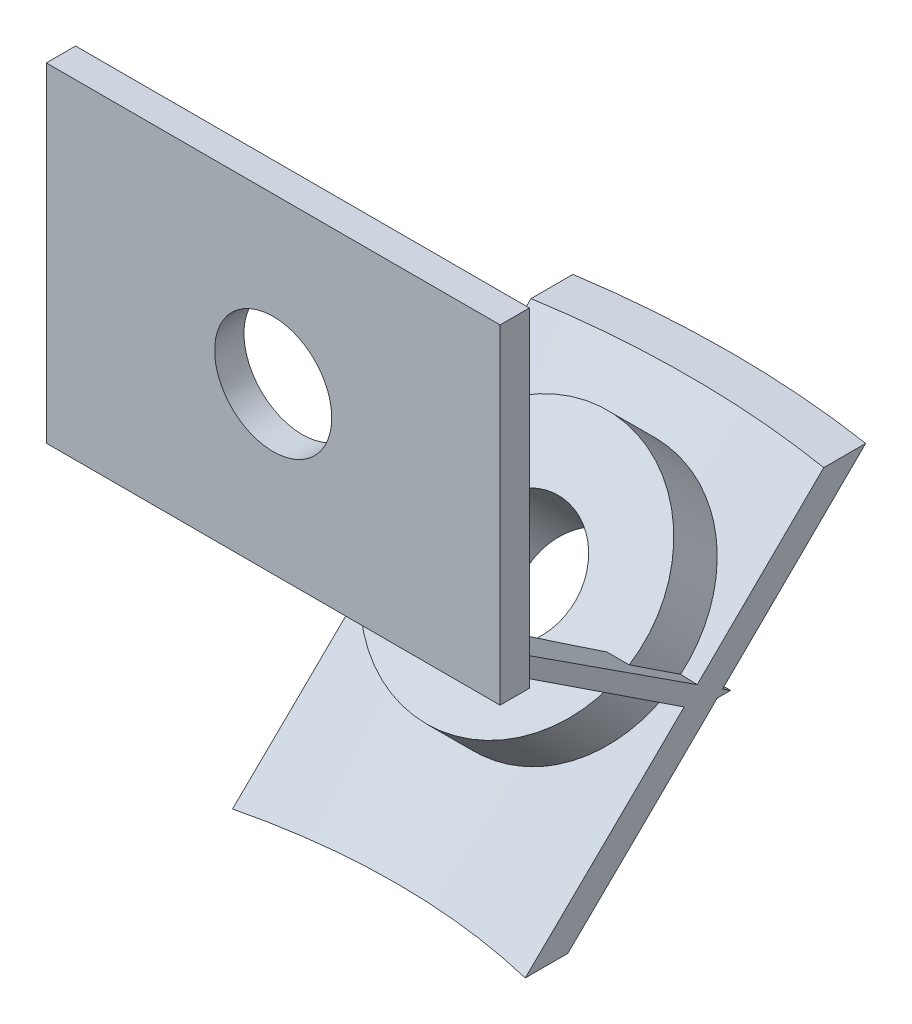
ISO-10303-21;
HEADER;
FILE_DESCRIPTION(('STEP AP214'),'2;1');
FILE_NAME('part.step','',(''),(''),'','','');
FILE_SCHEMA(('AUTOMOTIVE_DESIGN { 1 0 10303 214 1 1 1 1 }'));
ENDSEC;
DATA;
#1=APPLICATION_CONTEXT('core data for automotive mechanical design processes');
#2=APPLICATION_PROTOCOL_DEFINITION('international standard','automotive_design',2000,#1);
#3=PRODUCT_CONTEXT('',#1,'mechanical');
#4=PRODUCT('Part','Part','',(#3));
#5=PRODUCT_RELATED_PRODUCT_CATEGORY('part','',(#4));
#6=PRODUCT_DEFINITION_FORMATION('','',#4);
#7=PRODUCT_DEFINITION_CONTEXT('part definition',#1,'design');
#8=PRODUCT_DEFINITION('design','',#6,#7);
#9=PRODUCT_DEFINITION_SHAPE('','',#8);
#10=(LENGTH_UNIT() NAMED_UNIT(*) SI_UNIT(.MILLI.,.METRE.));
#11=(NAMED_UNIT(*) PLANE_ANGLE_UNIT() SI_UNIT($,.RADIAN.));
#12=(NAMED_UNIT(*) SI_UNIT($,.STERADIAN.) SOLID_ANGLE_UNIT());
#13=UNCERTAINTY_MEASURE_WITH_UNIT(LENGTH_MEASURE(1.E-05),#10,'distance_accuracy_value','');
#14=(GEOMETRIC_REPRESENTATION_CONTEXT(3) GLOBAL_UNCERTAINTY_ASSIGNED_CONTEXT((#13)) GLOBAL_UNIT_ASSIGNED_CONTEXT((#10,
#11,#12)) REPRESENTATION_CONTEXT('',''));
#15=CARTESIAN_POINT('',(0.,0.,0.));
#16=DIRECTION('',(0.,0.,1.));
#17=DIRECTION('',(1.,0.,0.));
#18=AXIS2_PLACEMENT_3D('',#15,#16,#17);
#19=CARTESIAN_POINT('',(-6.2,-53.,-14.3));
#20=DIRECTION('',(0.,1.,0.));
#21=DIRECTION('',(0.,0.,-1.));
#22=AXIS2_PLACEMENT_3D('',#19,#20,#21);
#23=PLANE('',#22);
#24=DIRECTION('',(0.,0.,1.));
#25=VECTOR('',#24,1.);
#26=CARTESIAN_POINT('',(-4.,-53.,-14.3));
#27=LINE('',#26,#25);
#28=CARTESIAN_POINT('',(-4.,-53.,-14.3));
#29=VERTEX_POINT('',#28);
#30=CARTESIAN_POINT('',(-4.,-53.,-13.5));
#31=VERTEX_POINT('',#30);
#32=EDGE_CURVE('E321',#29,#31,#27,.T.);
#33=ORIENTED_EDGE('',*,*,#32,.T.);
#34=DIRECTION('',(1.,0.,0.));
#35=VECTOR('',#34,1.);
#36=CARTESIAN_POINT('',(-6.2,-53.,-13.5));
#37=LINE('',#36,#35);
#38=CARTESIAN_POINT('',(-6.2,-53.,-13.5));
#39=VERTEX_POINT('',#38);
#40=EDGE_CURVE('E10',#39,#31,#37,.T.);
#41=ORIENTED_EDGE('',*,*,#40,.F.);
#42=DIRECTION('',(0.,0.,1.));
#43=VECTOR('',#42,1.);
#44=CARTESIAN_POINT('',(-6.2,-53.,-14.3));
#45=LINE('',#44,#43);
#46=CARTESIAN_POINT('',(-6.2,-53.,-14.3));
#47=VERTEX_POINT('',#46);
#48=EDGE_CURVE('E323',#47,#39,#45,.T.);
#49=ORIENTED_EDGE('',*,*,#48,.F.);
#50=DIRECTION('',(1.,0.,0.));
#51=VECTOR('',#50,1.);
#52=CARTESIAN_POINT('',(-6.2,-53.,-14.3));
#53=LINE('',#52,#51);
#54=EDGE_CURVE('E444',#47,#29,#53,.T.);
#55=ORIENTED_EDGE('',*,*,#54,.T.);
#56=EDGE_LOOP('',(#33,#41,#49,#55));
#57=FACE_BOUND('',#56,.T.);
#58=ADVANCED_FACE('F16',(#57),#23,.F.);
#59=CARTESIAN_POINT('',(-6.2,-53.,-13.5));
#60=DIRECTION('',(0.,0.,1.));
#61=DIRECTION('',(0.,-1.,0.));
#62=AXIS2_PLACEMENT_3D('',#59,#60,#61);
#63=PLANE('',#62);
#64=CARTESIAN_POINT('',(0.,-48.5,-13.5));
#65=DIRECTION('',(0.,0.,1.));
#66=DIRECTION('',(1.,0.,0.));
#67=AXIS2_PLACEMENT_3D('',#64,#65,#66);
#68=CIRCLE('',#67,1.6);
#69=CARTESIAN_POINT('',(1.6,-48.5,-13.5));
#70=VERTEX_POINT('',#69);
#71=EDGE_CURVE('E312',#70,#70,#68,.T.);
#72=ORIENTED_EDGE('',*,*,#71,.F.);
#73=EDGE_LOOP('',(#72));
#74=FACE_BOUND('',#73,.T.);
#75=DIRECTION('',(0.,1.,0.));
#76=VECTOR('',#75,1.);
#77=CARTESIAN_POINT('',(-6.2,-53.,-13.5));
#78=LINE('',#77,#76);
#79=CARTESIAN_POINT('',(-6.2,-44.,-13.5));
#80=VERTEX_POINT('',#79);
#81=EDGE_CURVE('E423',#39,#80,#78,.T.);
#82=ORIENTED_EDGE('',*,*,#81,.F.);
#83=ORIENTED_EDGE('',*,*,#40,.T.);
#84=DIRECTION('',(1.,0.,0.));
#85=VECTOR('',#84,1.);
#86=CARTESIAN_POINT('',(-4.,-53.,-13.5));
#87=LINE('',#86,#85);
#88=CARTESIAN_POINT('',(4.,-53.,-13.5));
#89=VERTEX_POINT('',#88);
#90=EDGE_CURVE('E277',#31,#89,#87,.T.);
#91=ORIENTED_EDGE('',*,*,#90,.T.);
#92=DIRECTION('',(1.,0.,0.));
#93=VECTOR('',#92,1.);
#94=CARTESIAN_POINT('',(-6.2,-53.,-13.5));
#95=LINE('',#94,#93);
#96=CARTESIAN_POINT('',(6.2,-53.,-13.5));
#97=VERTEX_POINT('',#96);
#98=EDGE_CURVE('E365',#89,#97,#95,.T.);
#99=ORIENTED_EDGE('',*,*,#98,.T.);
#100=DIRECTION('',(0.,1.,0.));
#101=VECTOR('',#100,1.);
#102=CARTESIAN_POINT('',(6.2,-53.,-13.5));
#103=LINE('',#102,#101);
#104=CARTESIAN_POINT('',(6.2,-44.,-13.5));
#105=VERTEX_POINT('',#104);
#106=EDGE_CURVE('E297',#97,#105,#103,.T.);
#107=ORIENTED_EDGE('',*,*,#106,.T.);
#108=DIRECTION('',(1.,0.,0.));
#109=VECTOR('',#108,1.);
#110=CARTESIAN_POINT('',(-6.2,-44.,-13.5));
#111=LINE('',#110,#109);
#112=EDGE_CURVE('E27',#80,#105,#111,.T.);
#113=ORIENTED_EDGE('',*,*,#112,.F.);
#114=EDGE_LOOP('',(#82,#83,#91,#99,#107,#113));
#115=FACE_BOUND('',#114,.T.);
#116=ADVANCED_FACE('F631',(#74,#115),#63,.T.);
#117=CARTESIAN_POINT('',(-6.2,-44.,-14.3));
#118=DIRECTION('',(0.,1.,0.));
#119=DIRECTION('',(0.,0.,-1.));
#120=AXIS2_PLACEMENT_3D('',#117,#118,#119);
#121=PLANE('',#120);
#122=DIRECTION('',(1.,0.,0.));
#123=VECTOR('',#122,1.);
#124=CARTESIAN_POINT('',(-6.2,-44.,-14.3));
#125=LINE('',#124,#123);
#126=CARTESIAN_POINT('',(-6.2,-44.,-14.3));
#127=VERTEX_POINT('',#126);
#128=CARTESIAN_POINT('',(6.2,-44.,-14.3));
#129=VERTEX_POINT('',#128);
#130=EDGE_CURVE('E327',#127,#129,#125,.T.);
#131=ORIENTED_EDGE('',*,*,#130,.F.);
#132=DIRECTION('',(0.,0.,1.));
#133=VECTOR('',#132,1.);
#134=CARTESIAN_POINT('',(-6.2,-44.,-14.3));
#135=LINE('',#134,#133);
#136=EDGE_CURVE('E377',#127,#80,#135,.T.);
#137=ORIENTED_EDGE('',*,*,#136,.T.);
#138=ORIENTED_EDGE('',*,*,#112,.T.);
#139=DIRECTION('',(0.,0.,1.));
#140=VECTOR('',#139,1.);
#141=CARTESIAN_POINT('',(6.2,-44.,-14.3));
#142=LINE('',#141,#140);
#143=EDGE_CURVE('E280',#129,#105,#142,.T.);
#144=ORIENTED_EDGE('',*,*,#143,.F.);
#145=EDGE_LOOP('',(#131,#137,#138,#144));
#146=FACE_BOUND('',#145,.T.);
#147=ADVANCED_FACE('F704',(#146),#121,.T.);
#148=CARTESIAN_POINT('',(6.2,-53.,-14.3));
#149=DIRECTION('',(1.,0.,0.));
#150=DIRECTION('',(0.,1.,0.));
#151=AXIS2_PLACEMENT_3D('',#148,#149,#150);
#152=PLANE('',#151);
#153=DIRECTION('',(0.,0.,1.));
#154=VECTOR('',#153,1.);
#155=CARTESIAN_POINT('',(6.2,-53.,-14.3));
#156=LINE('',#155,#154);
#157=CARTESIAN_POINT('',(6.2,-53.,-14.3));
#158=VERTEX_POINT('',#157);
#159=EDGE_CURVE('E316',#158,#97,#156,.T.);
#160=ORIENTED_EDGE('',*,*,#159,.F.);
#161=DIRECTION('',(0.,1.,0.));
#162=VECTOR('',#161,1.);
#163=CARTESIAN_POINT('',(6.2,-53.,-14.3));
#164=LINE('',#163,#162);
#165=EDGE_CURVE('E336',#158,#129,#164,.T.);
#166=ORIENTED_EDGE('',*,*,#165,.T.);
#167=ORIENTED_EDGE('',*,*,#143,.T.);
#168=ORIENTED_EDGE('',*,*,#106,.F.);
#169=EDGE_LOOP('',(#160,#166,#167,#168));
#170=FACE_BOUND('',#169,.T.);
#171=ADVANCED_FACE('F642',(#170),#152,.T.);
#172=CARTESIAN_POINT('',(-4.,-58.,-22.));
#173=DIRECTION('',(0.,-0.83869238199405,0.544605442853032));
#174=DIRECTION('',(-1.,0.,0.));
#175=AXIS2_PLACEMENT_3D('',#172,#173,#174);
#176=PLANE('',#175);
#177=DIRECTION('',(1.,0.,0.));
#178=VECTOR('',#177,1.);
#179=CARTESIAN_POINT('',(-4.,-53.,-14.3));
#180=LINE('',#179,#178);
#181=CARTESIAN_POINT('',(4.,-53.,-14.3));
#182=VERTEX_POINT('',#181);
#183=EDGE_CURVE('E412',#29,#182,#180,.T.);
#184=ORIENTED_EDGE('',*,*,#183,.T.);
#185=DIRECTION('',(0.,0.544605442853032,0.83869238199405));
#186=VECTOR('',#185,1.);
#187=CARTESIAN_POINT('',(4.,-58.,-22.));
#188=LINE('',#187,#186);
#189=CARTESIAN_POINT('',(4.,-57.4065293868,-21.08605525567));
#190=VERTEX_POINT('',#189);
#191=EDGE_CURVE('E246',#190,#182,#188,.T.);
#192=ORIENTED_EDGE('',*,*,#191,.F.);
#193=CARTESIAN_POINT('',(0.,-18.08411406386,39.470464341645));
#194=DIRECTION('',(0.,-0.83869238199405,0.544605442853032));
#195=DIRECTION('',(0.,0.544605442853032,0.83869238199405));
#196=AXIS2_PLACEMENT_3D('',#193,#194,#195);
#197=ELLIPSE('',#196,72.475339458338,46.225963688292);
#198=CARTESIAN_POINT('',(3.493501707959,-57.44169927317,-21.14021688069));
#199=VERTEX_POINT('',#198);
#200=EDGE_CURVE('E257',#199,#190,#197,.T.);
#201=ORIENTED_EDGE('',*,*,#200,.F.);
#202=CARTESIAN_POINT('',(0.,-58.,-22.));
#203=DIRECTION('',(0.,-0.83869238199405,0.544605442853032));
#204=DIRECTION('',(0.,-0.544605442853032,-0.83869238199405));
#205=AXIS2_PLACEMENT_3D('',#202,#203,#204);
#206=ELLIPSE('',#205,16.830898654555,3.5);
#207=CARTESIAN_POINT('',(3.45607594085,-56.55237981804,-19.77066491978));
#208=VERTEX_POINT('',#207);
#209=EDGE_CURVE('E478',#199,#208,#206,.T.);
#210=ORIENTED_EDGE('',*,*,#209,.T.);
#211=DIRECTION('',(1.,0.,0.));
#212=VECTOR('',#211,1.);
#213=CARTESIAN_POINT('',(-2.,-56.55237981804,-19.77066491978));
#214=LINE('',#213,#212);
#215=CARTESIAN_POINT('',(2.846833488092,-56.55237981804,-19.77066491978));
#216=VERTEX_POINT('',#215);
#217=EDGE_CURVE('E525',#216,#208,#214,.T.);
#218=ORIENTED_EDGE('',*,*,#217,.F.);
#219=CARTESIAN_POINT('',(0.,-58.,-22.));
#220=DIRECTION('',(0.,-0.83869238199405,0.544605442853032));
#221=DIRECTION('',(0.,-0.544605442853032,-0.83869238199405));
#222=AXIS2_PLACEMENT_3D('',#219,#220,#221);
#223=ELLIPSE('',#222,13.945601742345,2.9);
#224=CARTESIAN_POINT('',(2.604394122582,-54.65933804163,-16.85538058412));
#225=VERTEX_POINT('',#224);
#226=EDGE_CURVE('E311',#216,#225,#223,.T.);
#227=ORIENTED_EDGE('',*,*,#226,.T.);
#228=DIRECTION('',(1.,0.,0.));
#229=VECTOR('',#228,1.);
#230=CARTESIAN_POINT('',(-2.,-54.65933804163,-16.85538058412));
#231=LINE('',#230,#229);
#232=CARTESIAN_POINT('',(-2.604394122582,-54.65933804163,-16.85538058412));
#233=VERTEX_POINT('',#232);
#234=EDGE_CURVE('E378',#233,#225,#231,.T.);
#235=ORIENTED_EDGE('',*,*,#234,.F.);
#236=CARTESIAN_POINT('',(0.,-58.,-22.));
#237=DIRECTION('',(0.,-0.83869238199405,0.544605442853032));
#238=DIRECTION('',(0.,-0.544605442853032,-0.83869238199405));
#239=AXIS2_PLACEMENT_3D('',#236,#237,#238);
#240=ELLIPSE('',#239,13.945601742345,2.9);
#241=CARTESIAN_POINT('',(-2.846833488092,-56.55237981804,-19.77066491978));
#242=VERTEX_POINT('',#241);
#243=EDGE_CURVE('E348',#233,#242,#240,.T.);
#244=ORIENTED_EDGE('',*,*,#243,.T.);
#245=DIRECTION('',(1.,0.,0.));
#246=VECTOR('',#245,1.);
#247=CARTESIAN_POINT('',(-2.,-56.55237981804,-19.77066491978));
#248=LINE('',#247,#246);
#249=CARTESIAN_POINT('',(-3.45607594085,-56.55237981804,-19.77066491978));
#250=VERTEX_POINT('',#249);
#251=EDGE_CURVE('E341',#250,#242,#248,.T.);
#252=ORIENTED_EDGE('',*,*,#251,.F.);
#253=CARTESIAN_POINT('',(0.,-58.,-22.));
#254=DIRECTION('',(0.,-0.83869238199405,0.544605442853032));
#255=DIRECTION('',(0.,-0.544605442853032,-0.83869238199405));
#256=AXIS2_PLACEMENT_3D('',#253,#254,#255);
#257=ELLIPSE('',#256,16.830898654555,3.5);
#258=CARTESIAN_POINT('',(-3.493501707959,-57.44169927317,-21.14021688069));
#259=VERTEX_POINT('',#258);
#260=EDGE_CURVE('E256',#250,#259,#257,.T.);
#261=ORIENTED_EDGE('',*,*,#260,.T.);
#262=CARTESIAN_POINT('',(0.,-18.08411406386,39.470464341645));
#263=DIRECTION('',(0.,-0.83869238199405,0.544605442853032));
#264=DIRECTION('',(0.,0.544605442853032,0.83869238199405));
#265=AXIS2_PLACEMENT_3D('',#262,#263,#264);
#266=ELLIPSE('',#265,72.475339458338,46.225963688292);
#267=CARTESIAN_POINT('',(-4.,-57.4065293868,-21.08605525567));
#268=VERTEX_POINT('',#267);
#269=EDGE_CURVE('E464',#268,#259,#266,.T.);
#270=ORIENTED_EDGE('',*,*,#269,.F.);
#271=DIRECTION('',(0.,0.544605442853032,0.83869238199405));
#272=VECTOR('',#271,1.);
#273=CARTESIAN_POINT('',(-4.,-58.,-22.));
#274=LINE('',#273,#272);
#275=EDGE_CURVE('E294',#268,#29,#274,.T.);
#276=ORIENTED_EDGE('',*,*,#275,.T.);
#277=EDGE_LOOP('',(#184,#192,#201,#210,#218,#227,#235,#244,#252,#261,#270,#276));
#278=FACE_BOUND('',#277,.T.);
#279=ADVANCED_FACE('F697',(#278),#176,.F.);
#280=CARTESIAN_POINT('',(-4.,-53.,-13.5));
#281=DIRECTION('',(0.,0.835417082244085,-0.549616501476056));
#282=DIRECTION('',(-1.,0.,0.));
#283=AXIS2_PLACEMENT_3D('',#280,#281,#282);
#284=PLANE('',#283);
#285=CARTESIAN_POINT('',(0.,-17.59964197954,40.308544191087));
#286=DIRECTION('',(0.,0.835417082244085,-0.549616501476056));
#287=DIRECTION('',(0.,0.549616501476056,0.835417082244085));
#288=AXIS2_PLACEMENT_3D('',#285,#286,#287);
#289=ELLIPSE('',#288,73.339399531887,46.14228054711);
#290=CARTESIAN_POINT('',(-3.427003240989,-57.79685976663,-20.79122684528));
#291=VERTEX_POINT('',#290);
#292=CARTESIAN_POINT('',(-4.,-57.75644367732,-20.72979438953));
#293=VERTEX_POINT('',#292);
#294=EDGE_CURVE('E122',#291,#293,#289,.T.);
#295=ORIENTED_EDGE('',*,*,#294,.F.);
#296=CARTESIAN_POINT('',(0.,-59.73076923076,-23.73076923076));
#297=DIRECTION('',(0.,0.835417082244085,-0.549616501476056));
#298=DIRECTION('',(0.,-0.549616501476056,-0.835417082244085));
#299=AXIS2_PLACEMENT_3D('',#296,#297,#298);
#300=ELLIPSE('',#299,17.31888526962,3.5);
#301=CARTESIAN_POINT('',(-3.341422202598,-56.89803362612,-19.4250111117));
#302=VERTEX_POINT('',#301);
#303=EDGE_CURVE('E272',#291,#302,#300,.T.);
#304=ORIENTED_EDGE('',*,*,#303,.T.);
#305=DIRECTION('',(-1.,0.,0.));
#306=VECTOR('',#305,1.);
#307=CARTESIAN_POINT('',(-2.,-56.89803362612,-19.4250111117));
#308=LINE('',#307,#306);
#309=CARTESIAN_POINT('',(-2.706492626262,-56.89803362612,-19.4250111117));
#310=VERTEX_POINT('',#309);
#311=EDGE_CURVE('E340',#310,#302,#308,.T.);
#312=ORIENTED_EDGE('',*,*,#311,.F.);
#313=CARTESIAN_POINT('',(0.,-59.73076923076,-23.73076923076));
#314=DIRECTION('',(0.,0.835417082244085,-0.549616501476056));
#315=DIRECTION('',(0.,-0.549616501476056,-0.835417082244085));
#316=AXIS2_PLACEMENT_3D('',#313,#314,#315);
#317=ELLIPSE('',#316,14.349933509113,2.9);
#318=CARTESIAN_POINT('',(-2.317617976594,-54.98996770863,-16.52475091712));
#319=VERTEX_POINT('',#318);
#320=EDGE_CURVE('E343',#310,#319,#317,.T.);
#321=ORIENTED_EDGE('',*,*,#320,.T.);
#322=DIRECTION('',(-1.,0.,0.));
#323=VECTOR('',#322,1.);
#324=CARTESIAN_POINT('',(-2.,-54.98996770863,-16.52475091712));
#325=LINE('',#324,#323);
#326=CARTESIAN_POINT('',(2.317617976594,-54.98996770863,-16.52475091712));
#327=VERTEX_POINT('',#326);
#328=EDGE_CURVE('E20',#327,#319,#325,.T.);
#329=ORIENTED_EDGE('',*,*,#328,.F.);
#330=CARTESIAN_POINT('',(0.,-59.73076923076,-23.73076923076));
#331=DIRECTION('',(0.,0.835417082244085,-0.549616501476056));
#332=DIRECTION('',(0.,-0.549616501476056,-0.835417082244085));
#333=AXIS2_PLACEMENT_3D('',#330,#331,#332);
#334=ELLIPSE('',#333,14.349933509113,2.9);
#335=CARTESIAN_POINT('',(2.706492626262,-56.89803362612,-19.4250111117));
#336=VERTEX_POINT('',#335);
#337=EDGE_CURVE('E305',#327,#336,#334,.T.);
#338=ORIENTED_EDGE('',*,*,#337,.T.);
#339=DIRECTION('',(-1.,0.,0.));
#340=VECTOR('',#339,1.);
#341=CARTESIAN_POINT('',(-2.,-56.89803362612,-19.4250111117));
#342=LINE('',#341,#340);
#343=CARTESIAN_POINT('',(3.341422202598,-56.89803362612,-19.4250111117));
#344=VERTEX_POINT('',#343);
#345=EDGE_CURVE('E354',#344,#336,#342,.T.);
#346=ORIENTED_EDGE('',*,*,#345,.F.);
#347=CARTESIAN_POINT('',(0.,-59.73076923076,-23.73076923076));
#348=DIRECTION('',(0.,0.835417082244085,-0.549616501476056));
#349=DIRECTION('',(0.,-0.549616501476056,-0.835417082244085));
#350=AXIS2_PLACEMENT_3D('',#347,#348,#349);
#351=ELLIPSE('',#350,17.31888526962,3.5);
#352=CARTESIAN_POINT('',(3.427003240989,-57.79685976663,-20.79122684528));
#353=VERTEX_POINT('',#352);
#354=EDGE_CURVE('E357',#344,#353,#351,.T.);
#355=ORIENTED_EDGE('',*,*,#354,.T.);
#356=CARTESIAN_POINT('',(0.,-17.59964197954,40.308544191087));
#357=DIRECTION('',(0.,0.835417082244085,-0.549616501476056));
#358=DIRECTION('',(0.,0.549616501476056,0.835417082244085));
#359=AXIS2_PLACEMENT_3D('',#356,#357,#358);
#360=ELLIPSE('',#359,73.339399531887,46.14228054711);
#361=CARTESIAN_POINT('',(4.,-57.75644367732,-20.72979438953));
#362=VERTEX_POINT('',#361);
#363=EDGE_CURVE('E275',#362,#353,#360,.T.);
#364=ORIENTED_EDGE('',*,*,#363,.F.);
#365=DIRECTION('',(0.,-0.549616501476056,-0.835417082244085));
#366=VECTOR('',#365,1.);
#367=CARTESIAN_POINT('',(4.,-53.,-13.5));
#368=LINE('',#367,#366);
#369=EDGE_CURVE('E250',#89,#362,#368,.T.);
#370=ORIENTED_EDGE('',*,*,#369,.F.);
#371=ORIENTED_EDGE('',*,*,#90,.F.);
#372=DIRECTION('',(0.,-0.549616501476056,-0.835417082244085));
#373=VECTOR('',#372,1.);
#374=CARTESIAN_POINT('',(-4.,-53.,-13.5));
#375=LINE('',#374,#373);
#376=EDGE_CURVE('E318',#31,#293,#375,.T.);
#377=ORIENTED_EDGE('',*,*,#376,.T.);
#378=EDGE_LOOP('',(#295,#304,#312,#321,#329,#338,#346,#355,#364,#370,#371,#377));
#379=FACE_BOUND('',#378,.T.);
#380=ADVANCED_FACE('F575',(#379),#284,.F.);
#381=CARTESIAN_POINT('',(0.,-62.,0.));
#382=DIRECTION('',(0.,1.,0.));
#383=DIRECTION('',(0.,0.,1.));
#384=AXIS2_PLACEMENT_3D('',#381,#382,#383);
#385=CONICAL_SURFACE('',#384,16.86862915,0.785398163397);
#386=CARTESIAN_POINT('',(3.427003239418,-57.79685976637,-20.79122684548));
#387=CARTESIAN_POINT('',(3.393771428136,-57.91206886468,-20.67994076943));
#388=CARTESIAN_POINT('',(3.35148294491,-58.02695826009,-20.57045905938));
#389=CARTESIAN_POINT('',(3.300126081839,-58.14128574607,-20.46299949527));
#390=CARTESIAN_POINT('',(3.239631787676,-58.25477314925,-20.35779330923));
#391=CARTESIAN_POINT('',(3.169883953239,-58.36710543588,-20.25508076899));
#392=CARTESIAN_POINT('',(3.000526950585,-58.60404837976,-20.04133818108));
#393=CARTESIAN_POINT('',(2.898151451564,-58.72817165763,-19.93115523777));
#394=CARTESIAN_POINT('',(2.783234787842,-58.84980162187,-19.82489946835));
#395=CARTESIAN_POINT('',(2.655369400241,-58.96823567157,-19.72305231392));
#396=CARTESIAN_POINT('',(2.514134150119,-59.08257116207,-19.62619950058));
#397=CARTESIAN_POINT('',(2.261662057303,-59.26004631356,-19.47792236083));
#398=CARTESIAN_POINT('',(2.158910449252,-59.326357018,-19.42304283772));
#399=CARTESIAN_POINT('',(2.050573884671,-59.39029666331,-19.37060649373));
#400=CARTESIAN_POINT('',(1.936557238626,-59.45149892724,-19.32084647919));
#401=CARTESIAN_POINT('',(1.816820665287,-59.50952891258,-19.27403941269));
#402=CARTESIAN_POINT('',(1.597934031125,-59.60440707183,-19.19804695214));
#403=CARTESIAN_POINT('',(1.50131989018,-59.6428810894,-19.16741349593));
#404=CARTESIAN_POINT('',(1.401584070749,-59.67910886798,-19.13872707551));
#405=CARTESIAN_POINT('',(1.298799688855,-59.7128556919,-19.11213736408));
#406=CARTESIAN_POINT('',(1.1931045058,-59.74387362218,-19.08780284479));
#407=CARTESIAN_POINT('',(0.916024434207,-59.81556321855,-19.03176127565));
#408=CARTESIAN_POINT('',(0.74069040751,-59.85203547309,-19.00346078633));
#409=CARTESIAN_POINT('',(0.559769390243,-59.88032658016,-18.98163710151));
#410=CARTESIAN_POINT('',(0.374688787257,-59.89957256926,-18.96683618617));
#411=CARTESIAN_POINT('',(0.187303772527,-59.90918830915,-18.95944084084));
#412=CARTESIAN_POINT('',(-0.187447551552,-59.90918830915,-18.95944084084));
#413=CARTESIAN_POINT('',(-0.374976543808,-59.89955780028,-18.9668475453));
#414=CARTESIAN_POINT('',(-0.560195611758,-59.8802822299,-18.98167120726));
#415=CARTESIAN_POINT('',(-0.741245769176,-59.85194858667,-19.00352781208));
#416=CARTESIAN_POINT('',(-0.91669718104,-59.81542323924,-19.03186989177));
#417=CARTESIAN_POINT('',(-1.193891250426,-59.74364805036,-19.08797970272));
#418=CARTESIAN_POINT('',(-1.299593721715,-59.7126054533,-19.11233423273));
#419=CARTESIAN_POINT('',(-1.402383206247,-59.67883391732,-19.13894422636));
#420=CARTESIAN_POINT('',(-1.502122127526,-59.64258151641,-19.16765111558));
#421=CARTESIAN_POINT('',(-1.598737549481,-59.60408305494,-19.19830517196));
#422=CARTESIAN_POINT('',(-1.817567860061,-59.50917223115,-19.27432685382));
#423=CARTESIAN_POINT('',(-1.937250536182,-59.45113745,-19.32113973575));
#424=CARTESIAN_POINT('',(-2.051215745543,-59.38993351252,-19.37090320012));
#425=CARTESIAN_POINT('',(-2.159503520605,-59.32599482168,-19.42334094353));
#426=CARTESIAN_POINT('',(-2.262209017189,-59.25968727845,-19.47822008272));
#427=CARTESIAN_POINT('',(-2.514240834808,-59.08245549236,-19.62629972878));
#428=CARTESIAN_POINT('',(-2.655145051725,-58.96838505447,-19.72292906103));
#429=CARTESIAN_POINT('',(-2.782740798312,-58.8502344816,-19.82452992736));
#430=CARTESIAN_POINT('',(-2.897446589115,-58.72890041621,-19.93052050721));
#431=CARTESIAN_POINT('',(-2.999667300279,-58.60508109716,-20.04042247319));
#432=CARTESIAN_POINT('',(-3.169179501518,-58.36823932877,-20.25404403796));
#433=CARTESIAN_POINT('',(-3.239143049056,-58.25568959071,-20.35694377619));
#434=CARTESIAN_POINT('',(-3.299814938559,-58.14197814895,-20.4623487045));
#435=CARTESIAN_POINT('',(-3.35131216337,-58.02742213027,-20.57001702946));
#436=CARTESIAN_POINT('',(-3.393704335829,-57.91230146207,-20.67971609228));
#437=CARTESIAN_POINT('',(-3.4270032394,-57.79685976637,-20.79122684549));
#438=(BOUNDED_CURVE() B_SPLINE_CURVE(6,(#386,#387,#388,#389,#390,#391,#392,#393,#394,#395,#396,
#397,#398,#399,#400,#401,#402,#403,#404,#405,#406,#407,#408,#409,#410,#411,#412,#413,#414,#415,
#416,#417,#418,#419,#420,#421,#422,#423,#424,#425,#426,#427,#428,#429,#430,#431,#432,#433,#434,
#435,#436,#437),.UNSPECIFIED.,.F.,.F.) B_SPLINE_CURVE_WITH_KNOTS((7,5,5,5,5,5,5,5,5,5,7),(0.,
0.234205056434,0.500766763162,0.667900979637,0.792455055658,0.986311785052,1.180317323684,
1.304901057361,1.472001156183,1.737945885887,1.972623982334),
.UNSPECIFIED.) CURVE() GEOMETRIC_REPRESENTATION_ITEM() RATIONAL_B_SPLINE_CURVE((1.,1.,1.,1.,1.,
1.,1.,1.,1.,1.,1.,1.,1.,1.,1.,1.,1.,1.,1.,1.,1.,1.,1.,1.,1.,1.,1.,1.,1.,1.,1.,1.,1.,1.,1.,1.,1.,
1.,1.,1.,1.,1.,1.,1.,1.,1.,1.,1.,1.,1.,1.,1.)) REPRESENTATION_ITEM(''));
#439=EDGE_CURVE('E347',#353,#291,#438,.T.);
#440=ORIENTED_EDGE('',*,*,#439,.T.);
#441=ORIENTED_EDGE('',*,*,#294,.T.);
#442=CARTESIAN_POINT('',(-4.,-57.7564436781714,-20.7297943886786));
#443=CARTESIAN_POINT('',(-4.,-60.1264443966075,-18.3160755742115));
#444=CARTESIAN_POINT('',(-4.,-61.999999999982,-16.3875150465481));
#445=(BOUNDED_CURVE() B_SPLINE_CURVE(2,(#442,#443,#444),.UNSPECIFIED.,.F.,
.F.) B_SPLINE_CURVE_WITH_KNOTS((3,3),(0.,1.),
.UNSPECIFIED.) CURVE() GEOMETRIC_REPRESENTATION_ITEM() RATIONAL_B_SPLINE_CURVE((1.,
1.00660024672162,1.)) REPRESENTATION_ITEM(''));
#446=CARTESIAN_POINT('',(-3.999999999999,-62.,-16.38751504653));
#447=VERTEX_POINT('',#446);
#448=EDGE_CURVE('E322',#293,#447,#445,.T.);
#449=ORIENTED_EDGE('',*,*,#448,.T.);
#450=CARTESIAN_POINT('',(0.,-62.,0.));
#451=DIRECTION('',(0.,1.,0.));
#452=DIRECTION('',(0.,0.,1.));
#453=AXIS2_PLACEMENT_3D('',#450,#451,#452);
#454=CIRCLE('',#453,16.86862915);
#455=CARTESIAN_POINT('',(3.999999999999,-62.,-16.38751504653));
#456=VERTEX_POINT('',#455);
#457=EDGE_CURVE('E276',#456,#447,#454,.T.);
#458=ORIENTED_EDGE('',*,*,#457,.F.);
#459=CARTESIAN_POINT('',(4.,-57.7564436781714,-20.7297943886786));
#460=CARTESIAN_POINT('',(4.,-60.1264443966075,-18.3160755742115));
#461=CARTESIAN_POINT('',(4.,-61.999999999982,-16.3875150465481));
#462=(BOUNDED_CURVE() B_SPLINE_CURVE(2,(#459,#460,#461),.UNSPECIFIED.,.F.,
.F.) B_SPLINE_CURVE_WITH_KNOTS((3,3),(0.,1.),
.UNSPECIFIED.) CURVE() GEOMETRIC_REPRESENTATION_ITEM() RATIONAL_B_SPLINE_CURVE((1.,
1.00660024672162,1.)) REPRESENTATION_ITEM(''));
#463=EDGE_CURVE('E281',#362,#456,#462,.T.);
#464=ORIENTED_EDGE('',*,*,#463,.F.);
#465=ORIENTED_EDGE('',*,*,#363,.T.);
#466=EDGE_LOOP('',(#440,#441,#449,#458,#464,#465));
#467=FACE_BOUND('',#466,.T.);
#468=ADVANCED_FACE('F692',(#467),#385,.F.);
#469=CARTESIAN_POINT('',(0.,-62.,0.));
#470=DIRECTION('',(0.,1.,0.));
#471=DIRECTION('',(0.,0.,-1.));
#472=AXIS2_PLACEMENT_3D('',#469,#470,#471);
#473=PLANE('',#472);
#474=ORIENTED_EDGE('',*,*,#457,.T.);
#475=DIRECTION('',(0.,0.,1.));
#476=VECTOR('',#475,1.);
#477=CARTESIAN_POINT('',(-4.,-62.,-30.));
#478=LINE('',#477,#476);
#479=CARTESIAN_POINT('',(-4.,-62.,-17.54992877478));
#480=VERTEX_POINT('',#479);
#481=EDGE_CURVE('E264',#480,#447,#478,.T.);
#482=ORIENTED_EDGE('',*,*,#481,.F.);
#483=CARTESIAN_POINT('',(0.,-62.,0.));
#484=DIRECTION('',(0.,1.,0.));
#485=DIRECTION('',(0.,0.,1.));
#486=AXIS2_PLACEMENT_3D('',#483,#484,#485);
#487=CIRCLE('',#486,18.);
#488=CARTESIAN_POINT('',(4.,-62.,-17.54992877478));
#489=VERTEX_POINT('',#488);
#490=EDGE_CURVE('E393',#489,#480,#487,.T.);
#491=ORIENTED_EDGE('',*,*,#490,.F.);
#492=DIRECTION('',(0.,0.,1.));
#493=VECTOR('',#492,1.);
#494=CARTESIAN_POINT('',(4.,-62.,-30.));
#495=LINE('',#494,#493);
#496=EDGE_CURVE('E287',#489,#456,#495,.T.);
#497=ORIENTED_EDGE('',*,*,#496,.T.);
#498=EDGE_LOOP('',(#474,#482,#491,#497));
#499=FACE_BOUND('',#498,.T.);
#500=ADVANCED_FACE('F750',(#499),#473,.F.);
#501=CARTESIAN_POINT('',(0.,-62.,0.));
#502=DIRECTION('',(0.,1.,0.));
#503=DIRECTION('',(0.,0.,1.));
#504=AXIS2_PLACEMENT_3D('',#501,#502,#503);
#505=CONICAL_SURFACE('',#504,18.,0.785398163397);
#506=CARTESIAN_POINT('',(0.,-58.,0.));
#507=DIRECTION('',(0.,1.,0.));
#508=DIRECTION('',(0.,0.,1.));
#509=AXIS2_PLACEMENT_3D('',#506,#507,#508);
#510=CIRCLE('',#509,22.);
#511=CARTESIAN_POINT('',(4.,-58.,-21.63330765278));
#512=VERTEX_POINT('',#511);
#513=CARTESIAN_POINT('',(1.59947028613,-58.,-21.94177966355));
#514=VERTEX_POINT('',#513);
#515=EDGE_CURVE('E396',#512,#514,#510,.T.);
#516=ORIENTED_EDGE('',*,*,#515,.F.);
#517=CARTESIAN_POINT('',(4.,-58.0000000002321,-21.6333076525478));
#518=CARTESIAN_POINT('',(4.00000000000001,-60.2084247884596,-19.3874492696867));
#519=CARTESIAN_POINT('',(4.,-62.0000000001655,-17.5499287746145));
#520=(BOUNDED_CURVE() B_SPLINE_CURVE(2,(#517,#518,#519),.UNSPECIFIED.,.F.,
.F.) B_SPLINE_CURVE_WITH_KNOTS((3,3),(0.,1.),
.UNSPECIFIED.) CURVE() GEOMETRIC_REPRESENTATION_ITEM() RATIONAL_B_SPLINE_CURVE((1.,
1.00525170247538,1.)) REPRESENTATION_ITEM(''));
#521=EDGE_CURVE('E298',#512,#489,#520,.T.);
#522=ORIENTED_EDGE('',*,*,#521,.T.);
#523=ORIENTED_EDGE('',*,*,#490,.T.);
#524=CARTESIAN_POINT('',(-4.,-58.0000000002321,-21.6333076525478));
#525=CARTESIAN_POINT('',(-4.00000000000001,-60.2084247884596,-19.3874492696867));
#526=CARTESIAN_POINT('',(-4.,-62.0000000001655,-17.5499287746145));
#527=(BOUNDED_CURVE() B_SPLINE_CURVE(2,(#524,#525,#526),.UNSPECIFIED.,.F.,
.F.) B_SPLINE_CURVE_WITH_KNOTS((3,3),(0.,1.),
.UNSPECIFIED.) CURVE() GEOMETRIC_REPRESENTATION_ITEM() RATIONAL_B_SPLINE_CURVE((1.,
1.00525170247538,1.)) REPRESENTATION_ITEM(''));
#528=CARTESIAN_POINT('',(-4.,-58.,-21.63330765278));
#529=VERTEX_POINT('',#528);
#530=EDGE_CURVE('E258',#529,#480,#527,.T.);
#531=ORIENTED_EDGE('',*,*,#530,.F.);
#532=CARTESIAN_POINT('',(0.,-58.,0.));
#533=DIRECTION('',(0.,1.,0.));
#534=DIRECTION('',(0.,0.,1.));
#535=AXIS2_PLACEMENT_3D('',#532,#533,#534);
#536=CIRCLE('',#535,22.);
#537=CARTESIAN_POINT('',(-1.59947028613,-58.,-21.94177966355));
#538=VERTEX_POINT('',#537);
#539=EDGE_CURVE('E195',#538,#529,#536,.T.);
#540=ORIENTED_EDGE('',*,*,#539,.F.);
#541=CARTESIAN_POINT('',(-1.599470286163,-57.99999999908,-21.94177966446));
#542=CARTESIAN_POINT('',(-1.599319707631,-58.00413679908,-21.93764286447));
#543=CARTESIAN_POINT('',(-1.599144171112,-58.00827386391,-21.93350761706));
#544=CARTESIAN_POINT('',(-1.598943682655,-58.0124111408,-21.92937397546));
#545=CARTESIAN_POINT('',(-1.59871824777,-58.01654857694,-21.92524199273));
#546=CARTESIAN_POINT('',(-1.598467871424,-58.02068611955,-21.9211117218));
#547=CARTESIAN_POINT('',(-1.598192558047,-58.02482371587,-21.91698321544));
#548=CARTESIAN_POINT('',(-1.590148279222,-58.13567924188,-21.80641994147));
#549=CARTESIAN_POINT('',(-1.565827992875,-58.24226797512,-21.701321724));
#550=CARTESIAN_POINT('',(-1.525049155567,-58.3480343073,-21.59824778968));
#551=CARTESIAN_POINT('',(-1.467532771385,-58.45204277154,-21.4980791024));
#552=CARTESIAN_POINT('',(-1.392848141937,-58.55306545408,-21.40191147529));
#553=CARTESIAN_POINT('',(-1.300570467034,-58.64961634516,-21.31099727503));
#554=CARTESIAN_POINT('',(-1.152008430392,-58.77052992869,-21.19822123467));
#555=CARTESIAN_POINT('',(-1.112051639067,-58.80054808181,-21.17032377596));
#556=CARTESIAN_POINT('',(-1.069942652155,-58.82971457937,-21.14331216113));
#557=CARTESIAN_POINT('',(-1.025668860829,-58.8579311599,-21.11726759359));
#558=CARTESIAN_POINT('',(-0.979228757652,-58.88508735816,-21.09228119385));
#559=CARTESIAN_POINT('',(-0.930635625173,-58.91106194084,-21.06845268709));
#560=CARTESIAN_POINT('',(-0.840131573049,-58.95507404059,-21.02818607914));
#561=CARTESIAN_POINT('',(-0.799038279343,-58.97361492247,-21.01126269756));
#562=CARTESIAN_POINT('',(-0.756659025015,-58.99128341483,-20.99517117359));
#563=CARTESIAN_POINT('',(-0.713022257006,-59.00801070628,-20.97996803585));
#564=CARTESIAN_POINT('',(-0.66816961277,-59.02372485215,-20.96571238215));
#565=CARTESIAN_POINT('',(-0.622158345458,-59.03835287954,-20.95246414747));
#566=CARTESIAN_POINT('',(-0.499116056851,-59.07354547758,-20.92063727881));
#567=CARTESIAN_POINT('',(-0.420308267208,-59.09226888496,-20.903754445));
#568=CARTESIAN_POINT('',(-0.339017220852,-59.10766714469,-20.88990397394));
#569=CARTESIAN_POINT('',(-0.255714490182,-59.11945349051,-20.87932071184));
#570=CARTESIAN_POINT('',(-0.170972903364,-59.12739992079,-20.87219169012));
#571=CARTESIAN_POINT('',(-0.08547165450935,-59.13137084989,-20.8686291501));
#572=CARTESIAN_POINT('',(0.,-59.13137084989,-20.8686291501));
#573=(BOUNDED_CURVE() B_SPLINE_CURVE(7,(#541,#542,#543,#544,#545,#546,#547,#548,#549,#550,#551,
#552,#553,#554,#555,#556,#557,#558,#559,#560,#561,#562,#563,#564,#565,#566,#567,#568,#569,#570,
#571,#572),.UNSPECIFIED.,.F.,.F.) B_SPLINE_CURVE_WITH_KNOTS((8,6,6,6,6,8),(0.,0.01863550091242,
0.4992869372,0.663463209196,0.792273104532,1.),
.UNSPECIFIED.) CURVE() GEOMETRIC_REPRESENTATION_ITEM() RATIONAL_B_SPLINE_CURVE((1.,1.,1.,1.,1.,
1.,1.,1.,1.,1.,1.,1.,1.,1.,1.,1.,1.,1.,1.,1.,1.,1.,1.,1.,1.,1.,1.,1.,1.,1.,1.,1.)) REPRESENTATION_ITEM(''));
#574=CARTESIAN_POINT('',(0.,-59.13137084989,-20.8686291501));
#575=VERTEX_POINT('',#574);
#576=EDGE_CURVE('E204',#538,#575,#573,.T.);
#577=ORIENTED_EDGE('',*,*,#576,.T.);
#578=CARTESIAN_POINT('',(0.,-59.13137084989,-20.8686291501));
#579=CARTESIAN_POINT('',(0.08540303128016,-59.13137084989,-20.8686291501));
#580=CARTESIAN_POINT('',(0.17083559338,-59.12740629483,-20.87218597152));
#581=CARTESIAN_POINT('',(0.255510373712,-59.11947262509,-20.8793035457));
#582=CARTESIAN_POINT('',(0.338749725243,-59.10770498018,-20.88987000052));
#583=CARTESIAN_POINT('',(0.419981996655,-59.09233066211,-20.90369887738));
#584=CARTESIAN_POINT('',(0.498736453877,-59.0736356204,-20.92055599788));
#585=CARTESIAN_POINT('',(0.622000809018,-59.03840935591,-20.95241292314));
#586=CARTESIAN_POINT('',(0.668269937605,-59.02370240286,-20.96573255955));
#587=CARTESIAN_POINT('',(0.713367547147,-59.00789718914,-20.98007086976));
#588=CARTESIAN_POINT('',(0.757235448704,-58.99106791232,-20.99536691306));
#589=CARTESIAN_POINT('',(0.799831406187,-58.97328771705,-21.01156060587));
#590=CARTESIAN_POINT('',(0.841126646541,-58.95462653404,-21.0285944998));
#591=CARTESIAN_POINT('',(0.931780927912,-58.91045760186,-21.06900690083));
#592=CARTESIAN_POINT('',(0.980336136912,-58.88445602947,-21.09286161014));
#593=CARTESIAN_POINT('',(1.026737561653,-58.85727466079,-21.11787275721));
#594=CARTESIAN_POINT('',(1.070972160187,-58.82903460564,-21.14394071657));
#595=CARTESIAN_POINT('',(1.113041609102,-58.79984620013,-21.17097447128));
#596=CARTESIAN_POINT('',(1.152958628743,-58.76980758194,-21.19889291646));
#597=CARTESIAN_POINT('',(1.301089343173,-58.64904262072,-21.31153847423));
#598=CARTESIAN_POINT('',(1.393067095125,-58.55270179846,-21.40226003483));
#599=CARTESIAN_POINT('',(1.467535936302,-58.45191523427,-21.49820595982));
#600=CARTESIAN_POINT('',(1.524918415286,-58.34815783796,-21.59813309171));
#601=CARTESIAN_POINT('',(1.565641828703,-58.24264855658,-21.70095370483));
#602=CARTESIAN_POINT('',(1.589983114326,-58.13631687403,-21.80579266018));
#603=CARTESIAN_POINT('',(1.598141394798,-58.0255873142,-21.91622132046));
#604=CARTESIAN_POINT('',(1.598429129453,-58.02132244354,-21.92047653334));
#605=CARTESIAN_POINT('',(1.598690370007,-58.01705762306,-21.92473362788));
#606=CARTESIAN_POINT('',(1.598925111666,-58.01279291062,-21.92899254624));
#607=CARTESIAN_POINT('',(1.599133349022,-58.008528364,-21.9332532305));
#608=CARTESIAN_POINT('',(1.599315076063,-58.00426404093,-21.93751562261));
#609=CARTESIAN_POINT('',(1.599470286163,-57.99999999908,-21.94177966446));
#610=(BOUNDED_CURVE() B_SPLINE_CURVE(7,(#578,#579,#580,#581,#582,#583,#584,#585,#586,#587,#588,
#589,#590,#591,#592,#593,#594,#595,#596,#597,#598,#599,#600,#601,#602,#603,#604,#605,#606,#607,
#608,#609),.UNSPECIFIED.,.F.,.F.) B_SPLINE_CURVE_WITH_KNOTS((8,6,6,6,6,8),(0.,0.207560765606,
0.337084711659,0.501279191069,0.980791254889,1.),
.UNSPECIFIED.) CURVE() GEOMETRIC_REPRESENTATION_ITEM() RATIONAL_B_SPLINE_CURVE((1.,1.,1.,1.,1.,
1.,1.,1.,1.,1.,1.,1.,1.,1.,1.,1.,1.,1.,1.,1.,1.,1.,1.,1.,1.,1.,1.,1.,1.,1.,1.,1.)) REPRESENTATION_ITEM(''));
#611=EDGE_CURVE('E208',#575,#514,#610,.T.);
#612=ORIENTED_EDGE('',*,*,#611,.T.);
#613=EDGE_LOOP('',(#516,#522,#523,#531,#540,#577,#612));
#614=FACE_BOUND('',#613,.T.);
#615=ADVANCED_FACE('F206',(#614),#505,.T.);
#616=CARTESIAN_POINT('',(-4.,-58.,-21.1));
#617=DIRECTION('',(0.,1.,0.));
#618=DIRECTION('',(0.,0.,-1.));
#619=AXIS2_PLACEMENT_3D('',#616,#617,#618);
#620=PLANE('',#619);
#621=CARTESIAN_POINT('',(0.,-58.,-22.));
#622=DIRECTION('',(0.,1.,0.));
#623=DIRECTION('',(0.,0.,-1.));
#624=AXIS2_PLACEMENT_3D('',#621,#622,#623);
#625=ELLIPSE('',#624,2.262741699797,1.6);
#626=CARTESIAN_POINT('',(1.6,-58.,-22.));
#627=VERTEX_POINT('',#626);
#628=EDGE_CURVE('E227',#514,#627,#625,.T.);
#629=ORIENTED_EDGE('',*,*,#628,.T.);
#630=DIRECTION('',(1.,0.,0.));
#631=VECTOR('',#630,1.);
#632=CARTESIAN_POINT('',(-4.,-58.,-22.));
#633=LINE('',#632,#631);
#634=CARTESIAN_POINT('',(4.,-58.,-22.));
#635=VERTEX_POINT('',#634);
#636=EDGE_CURVE('E490',#627,#635,#633,.T.);
#637=ORIENTED_EDGE('',*,*,#636,.T.);
#638=DIRECTION('',(0.,0.,-1.));
#639=VECTOR('',#638,1.);
#640=CARTESIAN_POINT('',(4.,-58.,-21.1));
#641=LINE('',#640,#639);
#642=EDGE_CURVE('E304',#512,#635,#641,.T.);
#643=ORIENTED_EDGE('',*,*,#642,.F.);
#644=ORIENTED_EDGE('',*,*,#515,.T.);
#645=EDGE_LOOP('',(#629,#637,#643,#644));
#646=FACE_BOUND('',#645,.T.);
#647=ADVANCED_FACE('F744',(#646),#620,.F.);
#648=CARTESIAN_POINT('',(-4.,-58.,-22.));
#649=DIRECTION('',(0.,-0.83869238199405,0.544605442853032));
#650=DIRECTION('',(-1.,0.,0.));
#651=AXIS2_PLACEMENT_3D('',#648,#649,#650);
#652=PLANE('',#651);
#653=DIRECTION('',(0.,0.544605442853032,0.83869238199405));
#654=VECTOR('',#653,1.);
#655=CARTESIAN_POINT('',(4.,-58.,-22.));
#656=LINE('',#655,#654);
#657=CARTESIAN_POINT('',(4.,-57.85658364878,-21.77913881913));
#658=VERTEX_POINT('',#657);
#659=EDGE_CURVE('E538',#635,#658,#656,.T.);
#660=ORIENTED_EDGE('',*,*,#659,.F.);
#661=ORIENTED_EDGE('',*,*,#636,.F.);
#662=CARTESIAN_POINT('',(0.,-58.,-22.));
#663=DIRECTION('',(0.,-0.83869238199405,0.544605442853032));
#664=DIRECTION('',(0.,-0.544605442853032,-0.83869238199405));
#665=AXIS2_PLACEMENT_3D('',#662,#663,#664);
#666=ELLIPSE('',#665,7.694125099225,1.6);
#667=CARTESIAN_POINT('',(1.599976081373,-57.97708801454,-21.96471554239));
#668=VERTEX_POINT('',#667);
#669=EDGE_CURVE('E234',#627,#668,#666,.T.);
#670=ORIENTED_EDGE('',*,*,#669,.T.);
#671=CARTESIAN_POINT('',(0.,-17.25925925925,40.740740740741));
#672=DIRECTION('',(0.,-0.83869238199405,0.544605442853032));
#673=DIRECTION('',(0.,0.544605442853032,0.83869238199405));
#674=AXIS2_PLACEMENT_3D('',#671,#672,#673);
#675=ELLIPSE('',#674,74.807810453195,47.71365205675);
#676=EDGE_CURVE('E293',#668,#658,#675,.T.);
#677=ORIENTED_EDGE('',*,*,#676,.T.);
#678=EDGE_LOOP('',(#660,#661,#670,#677));
#679=FACE_BOUND('',#678,.T.);
#680=ADVANCED_FACE('F747',(#679),#652,.F.);
#681=CARTESIAN_POINT('',(0.,-62.,0.));
#682=DIRECTION('',(0.,1.,0.));
#683=DIRECTION('',(0.,0.,1.));
#684=AXIS2_PLACEMENT_3D('',#681,#682,#683);
#685=CONICAL_SURFACE('',#684,18.,0.785398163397);
#686=CARTESIAN_POINT('',(0.,-54.,0.));
#687=DIRECTION('',(0.,1.,0.));
#688=DIRECTION('',(0.,0.,1.));
#689=AXIS2_PLACEMENT_3D('',#686,#687,#688);
#690=CIRCLE('',#689,26.);
#691=CARTESIAN_POINT('',(3.999999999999,-54.,-25.69046515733));
#692=VERTEX_POINT('',#691);
#693=CARTESIAN_POINT('',(-3.999999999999,-54.,-25.69046515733));
#694=VERTEX_POINT('',#693);
#695=EDGE_CURVE('E107',#692,#694,#690,.T.);
#696=ORIENTED_EDGE('',*,*,#695,.F.);
#697=CARTESIAN_POINT('',(4.,-54.0000000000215,-25.6904651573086));
#698=CARTESIAN_POINT('',(3.99999999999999,-56.087176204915,-23.5781413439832));
#699=CARTESIAN_POINT('',(4.,-57.8565836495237,-21.7791388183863));
#700=(BOUNDED_CURVE() B_SPLINE_CURVE(2,(#697,#698,#699),.UNSPECIFIED.,.F.,
.F.) B_SPLINE_CURVE_WITH_KNOTS((3,3),(0.,1.),
.UNSPECIFIED.) CURVE() GEOMETRIC_REPRESENTATION_ITEM() RATIONAL_B_SPLINE_CURVE((1.,
1.00331665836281,1.)) REPRESENTATION_ITEM(''));
#701=EDGE_CURVE('E449',#692,#658,#700,.T.);
#702=ORIENTED_EDGE('',*,*,#701,.T.);
#703=ORIENTED_EDGE('',*,*,#676,.F.);
#704=CARTESIAN_POINT('',(1.59947028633,-57.9999999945,-21.94177966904));
#705=CARTESIAN_POINT('',(1.603272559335,-57.89554123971,-22.04623842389));
#706=CARTESIAN_POINT('',(1.591158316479,-57.79134451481,-22.15159399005));
#707=CARTESIAN_POINT('',(1.563083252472,-57.68809606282,-22.25714955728));
#708=CARTESIAN_POINT('',(1.51864796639,-57.58665748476,-22.36198761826));
#709=CARTESIAN_POINT('',(1.457337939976,-57.48809140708,-22.46492346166));
#710=CARTESIAN_POINT('',(1.378651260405,-57.39363706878,-22.56451557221));
#711=CARTESIAN_POINT('',(1.244990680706,-57.27098794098,-22.69492225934));
#712=CARTESIAN_POINT('',(1.205509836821,-57.23798901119,-22.73012974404));
#713=CARTESIAN_POINT('',(1.163394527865,-57.20591755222,-22.76446173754));
#714=CARTESIAN_POINT('',(1.118627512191,-57.17487908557,-22.79779354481));
#715=CARTESIAN_POINT('',(1.071205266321,-57.14499142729,-22.82998568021));
#716=CARTESIAN_POINT('',(1.021142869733,-57.11638309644,-22.86088561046));
#717=CARTESIAN_POINT('',(0.926388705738,-57.06745979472,-22.91386168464));
#718=CARTESIAN_POINT('',(0.882638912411,-57.04663411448,-22.93646256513));
#719=CARTESIAN_POINT('',(0.837251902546,-57.02678567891,-22.9580477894));
#720=CARTESIAN_POINT('',(0.790263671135,-57.00799104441,-22.97852637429));
#721=CARTESIAN_POINT('',(0.741726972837,-56.99033006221,-22.9978034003));
#722=CARTESIAN_POINT('',(0.691714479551,-56.97388361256,-23.01578270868));
#723=CARTESIAN_POINT('',(0.612729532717,-56.95059615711,-23.04127501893));
#724=CARTESIAN_POINT('',(0.584739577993,-56.9428339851,-23.04977912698));
#725=CARTESIAN_POINT('',(0.556367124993,-56.93545740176,-23.05786697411));
#726=CARTESIAN_POINT('',(0.527629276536,-56.92847854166,-23.06552414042));
#727=CARTESIAN_POINT('',(0.498545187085,-56.92190909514,-23.07273673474));
#728=CARTESIAN_POINT('',(0.469136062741,-56.91576030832,-23.07949139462));
#729=CARTESIAN_POINT('',(0.420493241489,-56.90639987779,-23.0897794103));
#730=CARTESIAN_POINT('',(0.401438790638,-56.90293190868,-23.09359244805));
#731=CARTESIAN_POINT('',(0.38226786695,-56.89964183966,-23.0972111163));
#732=CARTESIAN_POINT('',(0.362986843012,-56.89653227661,-23.10063231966));
#733=CARTESIAN_POINT('',(0.343602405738,-56.89360566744,-23.10385315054));
#734=CARTESIAN_POINT('',(0.324121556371,-56.89086430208,-23.10687088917));
#735=CARTESIAN_POINT('',(0.261850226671,-56.8827375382,-23.1158190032));
#736=CARTESIAN_POINT('',(0.218723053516,-56.8780566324,-23.12097628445));
#737=CARTESIAN_POINT('',(0.175248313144,-56.87428986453,-23.12512842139));
#738=CARTESIAN_POINT('',(0.131508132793,-56.87145464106,-23.12825474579));
#739=CARTESIAN_POINT('',(0.08758831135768,-56.86956302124,-23.13034093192));
#740=CARTESIAN_POINT('',(0.04357808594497,-56.86862123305,-23.13137958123));
#741=CARTESIAN_POINT('',(-0.06416346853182,-56.86864071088,-23.13135810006));
#742=CARTESIAN_POINT('',(-0.127902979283,-56.87064427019,-23.12914849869));
#743=CARTESIAN_POINT('',(-0.191360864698,-56.87464005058,-23.12474169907));
#744=CARTESIAN_POINT('',(-0.254269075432,-56.88059985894,-23.11817121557));
#745=CARTESIAN_POINT('',(-0.316380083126,-56.88847115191,-23.10949950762));
#746=CARTESIAN_POINT('',(-0.377467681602,-56.89818106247,-23.09881310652));
#747=CARTESIAN_POINT('',(-0.467110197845,-56.9153418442,-23.07995112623));
#748=CARTESIAN_POINT('',(-0.496590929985,-56.92147680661,-23.07321141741));
#749=CARTESIAN_POINT('',(-0.525746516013,-56.92803448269,-23.06601148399));
#750=CARTESIAN_POINT('',(-0.554555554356,-56.93500358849,-23.05836473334));
#751=CARTESIAN_POINT('',(-0.582998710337,-56.94237238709,-23.0502851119));
#752=CARTESIAN_POINT('',(-0.611058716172,-56.95012868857,-23.04178710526));
#753=CARTESIAN_POINT('',(-0.690188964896,-56.97338907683,-23.01632342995));
#754=CARTESIAN_POINT('',(-0.740277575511,-56.98981623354,-22.9983644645));
#755=CARTESIAN_POINT('',(-0.788889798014,-57.00746152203,-22.97910372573));
#756=CARTESIAN_POINT('',(-0.835952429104,-57.02624386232,-22.95863760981));
#757=CARTESIAN_POINT('',(-0.881412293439,-57.04608317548,-22.93706130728));
#758=CARTESIAN_POINT('',(-0.925233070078,-57.0669026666,-22.91446608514));
#759=CARTESIAN_POINT('',(-1.020089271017,-57.11579080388,-22.86152559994));
#760=CARTESIAN_POINT('',(-1.070186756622,-57.14436883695,-22.83065683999));
#761=CARTESIAN_POINT('',(-1.117645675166,-57.17422754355,-22.79849416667));
#762=CARTESIAN_POINT('',(-1.162450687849,-57.20523835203,-22.76519017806));
#763=CARTESIAN_POINT('',(-1.204605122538,-57.23728338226,-22.73088443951));
#764=CARTESIAN_POINT('',(-1.244126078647,-57.27025704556,-22.69570173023));
#765=CARTESIAN_POINT('',(-1.378076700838,-57.39294810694,-22.56524203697));
#766=CARTESIAN_POINT('',(-1.456965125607,-57.48749232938,-22.46554911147));
#767=CARTESIAN_POINT('',(-1.518431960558,-57.58616450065,-22.36249712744));
#768=CARTESIAN_POINT('',(-1.562980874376,-57.68771987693,-22.25753415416));
#769=CARTESIAN_POINT('',(-1.591128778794,-57.79109130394,-22.15185002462));
#770=CARTESIAN_POINT('',(-1.603277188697,-57.89541405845,-22.04636560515));
#771=CARTESIAN_POINT('',(-1.59947028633,-57.9999999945,-21.94177966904));
#772=(BOUNDED_CURVE() B_SPLINE_CURVE(7,(#704,#705,#706,#707,#708,#709,#710,#711,#712,#713,#714,
#715,#716,#717,#718,#719,#720,#721,#722,#723,#724,#725,#726,#727,#728,#729,#730,#731,#732,#733,
#734,#735,#736,#737,#738,#739,#740,#741,#742,#743,#744,#745,#746,#747,#748,#749,#750,#751,#752,
#753,#754,#755,#756,#757,#758,#759,#760,#761,#762,#763,#764,#765,#766,#767,#768,#769,#770,#771),
.UNSPECIFIED.,.F.,.F.) B_SPLINE_CURVE_WITH_KNOTS((8,6,6,6,6,6,6,6,6,6,6,8),(0.,0.229352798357,
0.316727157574,0.386558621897,0.424050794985,0.447940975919,0.500069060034,0.575561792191,
0.61312195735,0.683008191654,0.770363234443,1.),
.UNSPECIFIED.) CURVE() GEOMETRIC_REPRESENTATION_ITEM() RATIONAL_B_SPLINE_CURVE((1.,1.,1.,1.,1.,
1.,1.,1.,1.,1.,1.,1.,1.,1.,1.,1.,1.,1.,1.,1.,1.,1.,1.,1.,1.,1.,1.,1.,1.,1.,1.,1.,1.,1.,1.,1.,1.,
1.,1.,1.,1.,1.,1.,1.,1.,1.,1.,1.,1.,1.,1.,1.,1.,1.,1.,1.,1.,1.,1.,1.,1.,1.,1.,1.,1.,1.,1.,1.)) REPRESENTATION_ITEM(''));
#773=CARTESIAN_POINT('',(-1.599976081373,-57.97708801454,-21.96471554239));
#774=VERTEX_POINT('',#773);
#775=EDGE_CURVE('E403',#668,#774,#772,.T.);
#776=ORIENTED_EDGE('',*,*,#775,.T.);
#777=CARTESIAN_POINT('',(0.,-17.25925925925,40.740740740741));
#778=DIRECTION('',(0.,-0.83869238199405,0.544605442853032));
#779=DIRECTION('',(0.,0.544605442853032,0.83869238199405));
#780=AXIS2_PLACEMENT_3D('',#777,#778,#779);
#781=ELLIPSE('',#780,74.807810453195,47.71365205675);
#782=CARTESIAN_POINT('',(-4.,-57.85658364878,-21.77913881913));
#783=VERTEX_POINT('',#782);
#784=EDGE_CURVE('E245',#783,#774,#781,.T.);
#785=ORIENTED_EDGE('',*,*,#784,.F.);
#786=CARTESIAN_POINT('',(-4.,-54.0000000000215,-25.6904651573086));
#787=CARTESIAN_POINT('',(-3.99999999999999,-56.087176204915,-23.5781413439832));
#788=CARTESIAN_POINT('',(-4.,-57.8565836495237,-21.7791388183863));
#789=(BOUNDED_CURVE() B_SPLINE_CURVE(2,(#786,#787,#788),.UNSPECIFIED.,.F.,
.F.) B_SPLINE_CURVE_WITH_KNOTS((3,3),(0.,1.),
.UNSPECIFIED.) CURVE() GEOMETRIC_REPRESENTATION_ITEM() RATIONAL_B_SPLINE_CURVE((1.,
1.00331665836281,1.)) REPRESENTATION_ITEM(''));
#790=EDGE_CURVE('E265',#694,#783,#789,.T.);
#791=ORIENTED_EDGE('',*,*,#790,.F.);
#792=EDGE_LOOP('',(#696,#702,#703,#776,#785,#791));
#793=FACE_BOUND('',#792,.T.);
#794=ADVANCED_FACE('F753',(#793),#685,.T.);
#795=CARTESIAN_POINT('',(0.,-54.,0.));
#796=DIRECTION('',(0.,1.,0.));
#797=DIRECTION('',(0.,0.,-1.));
#798=AXIS2_PLACEMENT_3D('',#795,#796,#797);
#799=PLANE('',#798);
#800=DIRECTION('',(0.,0.,1.));
#801=VECTOR('',#800,1.);
#802=CARTESIAN_POINT('',(4.,-54.,-30.));
#803=LINE('',#802,#801);
#804=CARTESIAN_POINT('',(4.,-54.,-24.5448307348));
#805=VERTEX_POINT('',#804);
#806=EDGE_CURVE('E445',#692,#805,#803,.T.);
#807=ORIENTED_EDGE('',*,*,#806,.F.);
#808=ORIENTED_EDGE('',*,*,#695,.T.);
#809=DIRECTION('',(0.,0.,1.));
#810=VECTOR('',#809,1.);
#811=CARTESIAN_POINT('',(-4.,-54.,-30.));
#812=LINE('',#811,#810);
#813=CARTESIAN_POINT('',(-4.,-54.,-24.5448307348));
#814=VERTEX_POINT('',#813);
#815=EDGE_CURVE('E266',#694,#814,#812,.T.);
#816=ORIENTED_EDGE('',*,*,#815,.T.);
#817=CARTESIAN_POINT('',(0.,-54.,0.));
#818=DIRECTION('',(0.,1.,0.));
#819=DIRECTION('',(0.,0.,1.));
#820=AXIS2_PLACEMENT_3D('',#817,#818,#819);
#821=CIRCLE('',#820,24.86862915);
#822=EDGE_CURVE('E252',#805,#814,#821,.T.);
#823=ORIENTED_EDGE('',*,*,#822,.F.);
#824=EDGE_LOOP('',(#807,#808,#816,#823));
#825=FACE_BOUND('',#824,.T.);
#826=ADVANCED_FACE('F740',(#825),#799,.T.);
#827=CARTESIAN_POINT('',(-4.,-55.51251363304,-17.74592655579));
#828=DIRECTION('',(1.,0.,0.));
#829=DIRECTION('',(0.,1.,0.));
#830=AXIS2_PLACEMENT_3D('',#827,#828,#829);
#831=PLANE('',#830);
#832=CARTESIAN_POINT('',(-4.,-54.0000000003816,-24.5448307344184));
#833=CARTESIAN_POINT('',(-3.99999999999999,-55.8323704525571,-22.6882874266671));
#834=CARTESIAN_POINT('',(-4.,-57.4065293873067,-21.0860552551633));
#835=(BOUNDED_CURVE() B_SPLINE_CURVE(2,(#832,#833,#834),.UNSPECIFIED.,.F.,
.F.) B_SPLINE_CURVE_WITH_KNOTS((3,3),(0.,1.),
.UNSPECIFIED.) CURVE() GEOMETRIC_REPRESENTATION_ITEM() RATIONAL_B_SPLINE_CURVE((1.,
1.00279831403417,1.)) REPRESENTATION_ITEM(''));
#836=EDGE_CURVE('E454',#814,#268,#835,.T.);
#837=ORIENTED_EDGE('',*,*,#836,.F.);
#838=ORIENTED_EDGE('',*,*,#815,.F.);
#839=ORIENTED_EDGE('',*,*,#790,.T.);
#840=DIRECTION('',(0.,0.544605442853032,0.83869238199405));
#841=VECTOR('',#840,1.);
#842=CARTESIAN_POINT('',(-4.,-58.,-22.));
#843=LINE('',#842,#841);
#844=CARTESIAN_POINT('',(-4.,-58.,-22.));
#845=VERTEX_POINT('',#844);
#846=EDGE_CURVE('E370',#845,#783,#843,.T.);
#847=ORIENTED_EDGE('',*,*,#846,.F.);
#848=DIRECTION('',(0.,0.,-1.));
#849=VECTOR('',#848,1.);
#850=CARTESIAN_POINT('',(-4.,-58.,-21.1));
#851=LINE('',#850,#849);
#852=EDGE_CURVE('E385',#529,#845,#851,.T.);
#853=ORIENTED_EDGE('',*,*,#852,.F.);
#854=ORIENTED_EDGE('',*,*,#530,.T.);
#855=ORIENTED_EDGE('',*,*,#481,.T.);
#856=ORIENTED_EDGE('',*,*,#448,.F.);
#857=ORIENTED_EDGE('',*,*,#376,.F.);
#858=ORIENTED_EDGE('',*,*,#32,.F.);
#859=ORIENTED_EDGE('',*,*,#275,.F.);
#860=EDGE_LOOP('',(#837,#838,#839,#847,#853,#854,#855,#856,#857,#858,#859));
#861=FACE_BOUND('',#860,.T.);
#862=ADVANCED_FACE('F730',(#861),#831,.F.);
#863=CARTESIAN_POINT('',(0.,-56.16152236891,-20.16152236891));
#864=DIRECTION('',(0.,-0.707106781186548,-0.707106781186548));
#865=DIRECTION('',(0.,-0.707106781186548,0.707106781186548));
#866=AXIS2_PLACEMENT_3D('',#863,#864,#865);
#867=CYLINDRICAL_SURFACE('',#866,3.5);
#868=ORIENTED_EDGE('',*,*,#439,.F.);
#869=ORIENTED_EDGE('',*,*,#354,.F.);
#870=CARTESIAN_POINT('',(0.,-56.16152236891,-20.16152236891));
#871=DIRECTION('',(0.,-0.707106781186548,-0.707106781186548));
#872=DIRECTION('',(0.954692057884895,-0.210431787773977,0.210431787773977));
#873=AXIS2_PLACEMENT_3D('',#870,#871,#872);
#874=CIRCLE('',#873,3.5);
#875=EDGE_CURVE('E358',#344,#302,#874,.T.);
#876=ORIENTED_EDGE('',*,*,#875,.T.);
#877=ORIENTED_EDGE('',*,*,#303,.F.);
#878=EDGE_LOOP('',(#868,#869,#876,#877));
#879=FACE_BOUND('',#878,.T.);
#880=ADVANCED_FACE('F687',(#879),#867,.T.);
#881=CARTESIAN_POINT('',(0.,-53.75735931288,-17.75735931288));
#882=DIRECTION('',(0.,-0.707106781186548,-0.707106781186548));
#883=DIRECTION('',(0.,-0.707106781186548,0.707106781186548));
#884=AXIS2_PLACEMENT_3D('',#881,#882,#883);
#885=CYLINDRICAL_SURFACE('',#884,2.9);
#886=ORIENTED_EDGE('',*,*,#243,.F.);
#887=CARTESIAN_POINT('',(0.,-53.75735931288,-17.75735931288));
#888=DIRECTION('',(0.,-0.707106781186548,-0.707106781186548));
#889=DIRECTION('',(0.,-0.707106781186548,0.707106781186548));
#890=AXIS2_PLACEMENT_3D('',#887,#888,#889);
#891=CIRCLE('',#890,2.9);
#892=EDGE_CURVE('E382',#319,#233,#891,.T.);
#893=ORIENTED_EDGE('',*,*,#892,.F.);
#894=ORIENTED_EDGE('',*,*,#320,.F.);
#895=CARTESIAN_POINT('',(0.,-56.16152236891,-20.16152236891));
#896=DIRECTION('',(0.,-0.707106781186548,-0.707106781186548));
#897=DIRECTION('',(0.,-0.707106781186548,0.707106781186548));
#898=AXIS2_PLACEMENT_3D('',#895,#896,#897);
#899=CIRCLE('',#898,2.9);
#900=EDGE_CURVE('E337',#310,#242,#899,.T.);
#901=ORIENTED_EDGE('',*,*,#900,.T.);
#902=EDGE_LOOP('',(#886,#893,#894,#901));
#903=FACE_BOUND('',#902,.T.);
#904=ADVANCED_FACE('F729',(#903),#885,.F.);
#905=CARTESIAN_POINT('',(0.,-53.75735931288,-17.75735931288));
#906=DIRECTION('',(0.,-0.707106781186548,-0.707106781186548));
#907=DIRECTION('',(0.,-0.707106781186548,0.707106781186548));
#908=AXIS2_PLACEMENT_3D('',#905,#906,#907);
#909=PLANE('',#908);
#910=ORIENTED_EDGE('',*,*,#328,.T.);
#911=ORIENTED_EDGE('',*,*,#892,.T.);
#912=ORIENTED_EDGE('',*,*,#234,.T.);
#913=CARTESIAN_POINT('',(0.,-53.75735931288,-17.75735931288));
#914=DIRECTION('',(0.,-0.707106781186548,-0.707106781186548));
#915=DIRECTION('',(0.,-0.707106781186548,0.707106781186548));
#916=AXIS2_PLACEMENT_3D('',#913,#914,#915);
#917=CIRCLE('',#916,2.9);
#918=EDGE_CURVE('E389',#225,#327,#917,.T.);
#919=ORIENTED_EDGE('',*,*,#918,.T.);
#920=EDGE_LOOP('',(#910,#911,#912,#919));
#921=FACE_BOUND('',#920,.T.);
#922=ADVANCED_FACE('F569',(#921),#909,.T.);
#923=CARTESIAN_POINT('',(0.,-53.75735931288,-17.75735931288));
#924=DIRECTION('',(0.,-0.707106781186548,-0.707106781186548));
#925=DIRECTION('',(0.,-0.707106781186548,0.707106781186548));
#926=AXIS2_PLACEMENT_3D('',#923,#924,#925);
#927=CYLINDRICAL_SURFACE('',#926,2.9);
#928=ORIENTED_EDGE('',*,*,#918,.F.);
#929=ORIENTED_EDGE('',*,*,#226,.F.);
#930=CARTESIAN_POINT('',(0.,-56.16152236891,-20.16152236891));
#931=DIRECTION('',(0.,-0.707106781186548,-0.707106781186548));
#932=DIRECTION('',(0.,-0.707106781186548,0.707106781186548));
#933=AXIS2_PLACEMENT_3D('',#930,#931,#932);
#934=CIRCLE('',#933,2.9);
#935=EDGE_CURVE('E531',#216,#336,#934,.T.);
#936=ORIENTED_EDGE('',*,*,#935,.T.);
#937=ORIENTED_EDGE('',*,*,#337,.F.);
#938=EDGE_LOOP('',(#928,#929,#936,#937));
#939=FACE_BOUND('',#938,.T.);
#940=ADVANCED_FACE('F584',(#939),#927,.F.);
#941=CARTESIAN_POINT('',(-4.,-58.,-21.1));
#942=DIRECTION('',(0.,1.,0.));
#943=DIRECTION('',(0.,0.,-1.));
#944=AXIS2_PLACEMENT_3D('',#941,#942,#943);
#945=PLANE('',#944);
#946=DIRECTION('',(1.,0.,0.));
#947=VECTOR('',#946,1.);
#948=CARTESIAN_POINT('',(-4.,-58.,-22.));
#949=LINE('',#948,#947);
#950=CARTESIAN_POINT('',(-1.6,-58.,-22.));
#951=VERTEX_POINT('',#950);
#952=EDGE_CURVE('E332',#845,#951,#949,.T.);
#953=ORIENTED_EDGE('',*,*,#952,.T.);
#954=CARTESIAN_POINT('',(0.,-58.,-22.));
#955=DIRECTION('',(0.,1.,0.));
#956=DIRECTION('',(0.,0.,-1.));
#957=AXIS2_PLACEMENT_3D('',#954,#955,#956);
#958=ELLIPSE('',#957,2.262741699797,1.6);
#959=EDGE_CURVE('E213',#951,#538,#958,.T.);
#960=ORIENTED_EDGE('',*,*,#959,.T.);
#961=ORIENTED_EDGE('',*,*,#539,.T.);
#962=ORIENTED_EDGE('',*,*,#852,.T.);
#963=EDGE_LOOP('',(#953,#960,#961,#962));
#964=FACE_BOUND('',#963,.T.);
#965=ADVANCED_FACE('F18',(#964),#945,.F.);
#966=CARTESIAN_POINT('',(-4.,-58.,-22.));
#967=DIRECTION('',(0.,-0.83869238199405,0.544605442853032));
#968=DIRECTION('',(-1.,0.,0.));
#969=AXIS2_PLACEMENT_3D('',#966,#967,#968);
#970=PLANE('',#969);
#971=ORIENTED_EDGE('',*,*,#784,.T.);
#972=CARTESIAN_POINT('',(0.,-58.,-22.));
#973=DIRECTION('',(0.,-0.83869238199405,0.544605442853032));
#974=DIRECTION('',(0.,-0.544605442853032,-0.83869238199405));
#975=AXIS2_PLACEMENT_3D('',#972,#973,#974);
#976=ELLIPSE('',#975,7.694125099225,1.6);
#977=EDGE_CURVE('E353',#774,#951,#976,.T.);
#978=ORIENTED_EDGE('',*,*,#977,.T.);
#979=ORIENTED_EDGE('',*,*,#952,.F.);
#980=ORIENTED_EDGE('',*,*,#846,.T.);
#981=EDGE_LOOP('',(#971,#978,#979,#980));
#982=FACE_BOUND('',#981,.T.);
#983=ADVANCED_FACE('F734',(#982),#970,.F.);
#984=CARTESIAN_POINT('',(0.,-55.87867965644,-19.87867965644));
#985=DIRECTION('',(0.,-0.707106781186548,-0.707106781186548));
#986=DIRECTION('',(0.,-0.707106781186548,0.707106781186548));
#987=AXIS2_PLACEMENT_3D('',#984,#985,#986);
#988=CYLINDRICAL_SURFACE('',#987,1.6);
#989=ORIENTED_EDGE('',*,*,#977,.F.);
#990=ORIENTED_EDGE('',*,*,#775,.F.);
#991=ORIENTED_EDGE('',*,*,#669,.F.);
#992=ORIENTED_EDGE('',*,*,#628,.F.);
#993=ORIENTED_EDGE('',*,*,#611,.F.);
#994=DIRECTION('',(0.,-0.707106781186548,-0.707106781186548));
#995=VECTOR('',#994,1.);
#996=CARTESIAN_POINT('',(0.,-57.01005050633,-18.74730880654));
#997=LINE('',#996,#995);
#998=CARTESIAN_POINT('',(0.,-57.29289321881,-19.03015151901));
#999=VERTEX_POINT('',#998);
#1000=EDGE_CURVE('E214',#999,#575,#997,.T.);
#1001=ORIENTED_EDGE('',*,*,#1000,.F.);
#1002=CARTESIAN_POINT('',(0.,-56.16152236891,-20.16152236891));
#1003=DIRECTION('',(0.,-0.707106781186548,-0.707106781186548));
#1004=DIRECTION('',(0.,-0.707106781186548,0.707106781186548));
#1005=AXIS2_PLACEMENT_3D('',#1002,#1003,#1004);
#1006=CIRCLE('',#1005,1.6);
#1007=EDGE_CURVE('E222',#999,#999,#1006,.T.);
#1008=ORIENTED_EDGE('',*,*,#1007,.F.);
#1009=ORIENTED_EDGE('',*,*,#1000,.T.);
#1010=ORIENTED_EDGE('',*,*,#576,.F.);
#1011=ORIENTED_EDGE('',*,*,#959,.F.);
#1012=EDGE_LOOP('',(#989,#990,#991,#992,#993,#1001,#1008,#1009,#1010,#1011));
#1013=FACE_BOUND('',#1012,.T.);
#1014=ADVANCED_FACE('F219',(#1013),#988,.F.);
#1015=CARTESIAN_POINT('',(0.,-56.16152236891,-20.16152236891));
#1016=DIRECTION('',(0.,-0.707106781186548,-0.707106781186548));
#1017=DIRECTION('',(0.,-0.707106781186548,0.707106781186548));
#1018=AXIS2_PLACEMENT_3D('',#1015,#1016,#1017);
#1019=PLANE('',#1018);
#1020=ORIENTED_EDGE('',*,*,#1007,.T.);
#1021=EDGE_LOOP('',(#1020));
#1022=FACE_BOUND('',#1021,.T.);
#1023=ORIENTED_EDGE('',*,*,#935,.F.);
#1024=ORIENTED_EDGE('',*,*,#217,.T.);
#1025=CARTESIAN_POINT('',(0.,-56.16152236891,-20.16152236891));
#1026=DIRECTION('',(0.,-0.707106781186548,-0.707106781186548));
#1027=DIRECTION('',(0.,-0.707106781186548,0.707106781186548));
#1028=AXIS2_PLACEMENT_3D('',#1025,#1026,#1027);
#1029=CIRCLE('',#1028,3.5);
#1030=EDGE_CURVE('E594',#250,#208,#1029,.T.);
#1031=ORIENTED_EDGE('',*,*,#1030,.F.);
#1032=ORIENTED_EDGE('',*,*,#251,.T.);
#1033=ORIENTED_EDGE('',*,*,#900,.F.);
#1034=ORIENTED_EDGE('',*,*,#311,.T.);
#1035=ORIENTED_EDGE('',*,*,#875,.F.);
#1036=ORIENTED_EDGE('',*,*,#345,.T.);
#1037=EDGE_LOOP('',(#1023,#1024,#1031,#1032,#1033,#1034,#1035,#1036));
#1038=FACE_BOUND('',#1037,.T.);
#1039=ADVANCED_FACE('F689',(#1022,#1038),#1019,.F.);
#1040=CARTESIAN_POINT('',(0.,-56.16152236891,-20.16152236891));
#1041=DIRECTION('',(0.,-0.707106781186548,-0.707106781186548));
#1042=DIRECTION('',(0.,-0.707106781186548,0.707106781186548));
#1043=AXIS2_PLACEMENT_3D('',#1040,#1041,#1042);
#1044=CYLINDRICAL_SURFACE('',#1043,3.5);
#1045=ORIENTED_EDGE('',*,*,#260,.F.);
#1046=ORIENTED_EDGE('',*,*,#1030,.T.);
#1047=ORIENTED_EDGE('',*,*,#209,.F.);
#1048=CARTESIAN_POINT('',(3.475428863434,-57.58422523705,-20.99874387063));
#1049=CARTESIAN_POINT('',(3.487368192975,-57.51285060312,-21.06911342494));
#1050=CARTESIAN_POINT('',(3.495838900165,-57.44147174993,-21.14006135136));
#1051=CARTESIAN_POINT('',(3.500831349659,-57.37014489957,-21.21153240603));
#1052=CARTESIAN_POINT('',(3.502328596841,-57.29892647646,-21.28346806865));
#1053=CARTESIAN_POINT('',(3.500306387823,-57.22787310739,-21.35580654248));
#1054=CARTESIAN_POINT('',(3.489091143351,-57.0853358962,-21.50205597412));
#1055=CARTESIAN_POINT('',(3.479810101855,-57.01385843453,-21.57597439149));
#1056=CARTESIAN_POINT('',(3.46685730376,-56.94266813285,-21.65017066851));
#1057=CARTESIAN_POINT('',(3.450193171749,-56.87182700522,-21.72457086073));
#1058=CARTESIAN_POINT('',(3.429771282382,-56.80140018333,-21.79909441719));
#1059=CARTESIAN_POINT('',(3.380328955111,-56.65869316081,-21.95121841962));
#1060=CARTESIAN_POINT('',(3.350995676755,-56.58645389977,-22.02882044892));
#1061=CARTESIAN_POINT('',(3.317478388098,-56.51481455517,-22.10636244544));
#1062=CARTESIAN_POINT('',(3.279710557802,-56.44385951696,-22.18373401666));
#1063=CARTESIAN_POINT('',(3.237619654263,-56.37368112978,-22.26081173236));
#1064=CARTESIAN_POINT('',(3.141548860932,-56.23047739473,-22.41919407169));
#1065=CARTESIAN_POINT('',(3.086966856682,-56.15757479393,-22.50043688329));
#1066=CARTESIAN_POINT('',(3.027285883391,-56.0857922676,-22.58102240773));
#1067=CARTESIAN_POINT('',(2.96240843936,-56.01526916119,-22.66075883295));
#1068=CARTESIAN_POINT('',(2.892238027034,-55.94616324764,-22.73942691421));
#1069=CARTESIAN_POINT('',(2.720513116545,-55.79271850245,-22.91523550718));
#1070=CARTESIAN_POINT('',(2.61562947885,-55.70937658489,-23.01154968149));
#1071=CARTESIAN_POINT('',(2.501833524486,-55.62897807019,-23.10522355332));
#1072=CARTESIAN_POINT('',(2.378976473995,-55.55196632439,-23.19563515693));
#1073=CARTESIAN_POINT('',(2.247002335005,-55.47885991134,-23.28205576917));
#1074=CARTESIAN_POINT('',(1.997882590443,-55.35762732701,-23.42623543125));
#1075=CARTESIAN_POINT('',(1.884472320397,-55.30765795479,-23.48597081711));
#1076=CARTESIAN_POINT('',(1.765812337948,-55.2605952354,-23.54249925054));
#1077=CARTESIAN_POINT('',(1.642030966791,-55.2167388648,-23.59539985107));
#1078=CARTESIAN_POINT('',(1.513363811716,-55.1764043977,-23.64423000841));
#1079=CARTESIAN_POINT('',(1.3101022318,-55.12069789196,-23.71187376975));
#1080=CARTESIAN_POINT('',(1.238772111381,-55.10255322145,-23.73394750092));
#1081=CARTESIAN_POINT('',(1.166249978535,-55.08551653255,-23.75470820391));
#1082=CARTESIAN_POINT('',(1.092602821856,-55.06963306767,-23.7740925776));
#1083=CARTESIAN_POINT('',(1.017909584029,-55.05494611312,-23.79204010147));
#1084=CARTESIAN_POINT('',(0.791627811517,-55.01471192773,-23.84126127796));
#1085=CARTESIAN_POINT('',(0.637174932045,-54.99282461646,-23.86811683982));
#1086=CARTESIAN_POINT('',(0.479691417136,-54.97616461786,-23.88860243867));
#1087=CARTESIAN_POINT('',(0.320078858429,-54.96497536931,-23.90237572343));
#1088=CARTESIAN_POINT('',(0.159355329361,-54.95940218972,-23.90923588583));
#1089=CARTESIAN_POINT('',(-0.112024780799,-54.95946773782,-23.90915520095));
#1090=CARTESIAN_POINT('',(-0.222718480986,-54.96215752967,-23.90584428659));
#1091=CARTESIAN_POINT('',(-0.333051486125,-54.96751034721,-23.89925533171));
#1092=CARTESIAN_POINT('',(-0.442681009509,-54.97549506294,-23.88943178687));
#1093=CARTESIAN_POINT('',(-0.55128461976,-54.98605322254,-23.87645519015));
#1094=CARTESIAN_POINT('',(-0.707109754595,-55.00500865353,-23.85319168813));
#1095=CARTESIAN_POINT('',(-0.755388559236,-55.01142494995,-23.84532098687));
#1096=CARTESIAN_POINT('',(-0.803369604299,-55.01834416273,-23.83683818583));
#1097=CARTESIAN_POINT('',(-0.85102757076,-55.02575804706,-23.82775479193));
#1098=CARTESIAN_POINT('',(-0.898338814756,-55.03365765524,-23.81808329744));
#1099=CARTESIAN_POINT('',(-1.021014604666,-55.0555459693,-23.79130694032));
#1100=CARTESIAN_POINT('',(-1.095788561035,-55.07029786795,-23.77328088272));
#1101=CARTESIAN_POINT('',(-1.169510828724,-55.08624881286,-23.75381516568));
#1102=CARTESIAN_POINT('',(-1.242102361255,-55.10335526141,-23.73297066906));
#1103=CARTESIAN_POINT('',(-1.313496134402,-55.1215717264,-23.71081103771));
#1104=CARTESIAN_POINT('',(-1.516596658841,-55.17740125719,-23.64302277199));
#1105=CARTESIAN_POINT('',(-1.645046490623,-55.21777272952,-23.59415161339));
#1106=CARTESIAN_POINT('',(-1.768615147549,-55.26165449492,-23.54122470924));
#1107=CARTESIAN_POINT('',(-1.887069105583,-55.30873203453,-23.48468322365));
#1108=CARTESIAN_POINT('',(-2.000281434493,-55.35870675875,-23.42494648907));
#1109=CARTESIAN_POINT('',(-2.249343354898,-55.48011627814,-23.28056851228));
#1110=CARTESIAN_POINT('',(-2.381415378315,-55.55341232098,-23.19393244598));
#1111=CARTESIAN_POINT('',(-2.504338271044,-55.63062088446,-23.10330061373));
#1112=CARTESIAN_POINT('',(-2.618169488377,-55.71122143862,-23.00940449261));
#1113=CARTESIAN_POINT('',(-2.723059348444,-55.79476911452,-22.91286813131));
#1114=CARTESIAN_POINT('',(-2.89418978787,-55.94808769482,-22.73723636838));
#1115=CARTESIAN_POINT('',(-2.963849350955,-56.01683724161,-22.65898603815));
#1116=CARTESIAN_POINT('',(-3.028276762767,-56.08698552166,-22.57968293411));
#1117=CARTESIAN_POINT('',(-3.087566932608,-56.15837762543,-22.49954230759));
#1118=CARTESIAN_POINT('',(-3.141815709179,-56.23087663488,-22.41875262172));
#1119=CARTESIAN_POINT('',(-3.237252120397,-56.37313190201,-22.26141907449));
#1120=CARTESIAN_POINT('',(-3.279053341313,-56.44276318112,-22.1849381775));
#1121=CARTESIAN_POINT('',(-3.31659733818,-56.51315996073,-22.10816670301));
#1122=CARTESIAN_POINT('',(-3.349954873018,-56.58423195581,-22.03122553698));
#1123=CARTESIAN_POINT('',(-3.379190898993,-56.65589660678,-21.95422290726));
#1124=CARTESIAN_POINT('',(-3.428659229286,-56.79774114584,-21.80297338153));
#1125=CARTESIAN_POINT('',(-3.44916976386,-56.86788436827,-21.7287254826));
#1126=CARTESIAN_POINT('',(-3.4659489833,-56.93844114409,-21.65459707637));
#1127=CARTESIAN_POINT('',(-3.479042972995,-57.00934697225,-21.58066800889));
#1128=CARTESIAN_POINT('',(-3.488491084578,-57.08054045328,-21.50701158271));
#1129=CARTESIAN_POINT('',(-3.50018052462,-57.22362772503,-21.36012952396));
#1130=CARTESIAN_POINT('',(-3.502397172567,-57.29552219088,-21.28690713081));
#1131=CARTESIAN_POINT('',(-3.501008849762,-57.36758775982,-21.21409496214));
#1132=CARTESIAN_POINT('',(-3.496040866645,-57.43976573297,-21.14175715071));
#1133=CARTESIAN_POINT('',(-3.487510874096,-57.51199763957,-21.06995437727));
#1134=CARTESIAN_POINT('',(-3.475428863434,-57.58422523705,-20.99874387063));
#1135=(BOUNDED_CURVE() B_SPLINE_CURVE(6,(#1048,#1049,#1050,#1051,#1052,#1053,#1054,#1055,#1056,
#1057,#1058,#1059,#1060,#1061,#1062,#1063,#1064,#1065,#1066,#1067,#1068,#1069,#1070,#1071,#1072,
#1073,#1074,#1075,#1076,#1077,#1078,#1079,#1080,#1081,#1082,#1083,#1084,#1085,#1086,#1087,#1088,
#1089,#1090,#1091,#1092,#1093,#1094,#1095,#1096,#1097,#1098,#1099,#1100,#1101,#1102,#1103,#1104,
#1105,#1106,#1107,#1108,#1109,#1110,#1111,#1112,#1113,#1114,#1115,#1116,#1117,#1118,#1119,#1120,
#1121,#1122,#1123,#1124,#1125,#1126,#1127,#1128,#1129,#1130,#1131,#1132,#1133,#1134),
.UNSPECIFIED.,.F.,.F.) B_SPLINE_CURVE_WITH_KNOTS((7,5,5,5,5,5,5,5,5,5,5,5,5,5,5,5,5,7),(0.,
0.05926093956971,0.119253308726,0.181663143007,0.248216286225,0.332926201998,0.397871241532,
0.432046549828,0.500099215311,0.546977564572,0.568193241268,0.602420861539,0.667304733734,
0.752161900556,0.818339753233,0.880267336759,0.940032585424,1.),
.UNSPECIFIED.) CURVE() GEOMETRIC_REPRESENTATION_ITEM() RATIONAL_B_SPLINE_CURVE((1.,1.,1.,1.,1.,
1.,1.,1.,1.,1.,1.,1.,1.,1.,1.,1.,1.,1.,1.,1.,1.,1.,1.,1.,1.,1.,1.,1.,1.,1.,1.,1.,1.,1.,1.,1.,1.,
1.,1.,1.,1.,1.,1.,1.,1.,1.,1.,1.,1.,1.,1.,1.,1.,1.,1.,1.,1.,1.,1.,1.,1.,1.,1.,1.,1.,1.,1.,1.,1.,
1.,1.,1.,1.,1.,1.,1.,1.,1.,1.,1.,1.,1.,1.,1.,1.,1.,1.)) REPRESENTATION_ITEM(''));
#1136=EDGE_CURVE('E437',#199,#259,#1135,.T.);
#1137=ORIENTED_EDGE('',*,*,#1136,.T.);
#1138=EDGE_LOOP('',(#1045,#1046,#1047,#1137));
#1139=FACE_BOUND('',#1138,.T.);
#1140=ADVANCED_FACE('F725',(#1139),#1044,.T.);
#1141=CARTESIAN_POINT('',(0.,-62.,0.));
#1142=DIRECTION('',(0.,1.,0.));
#1143=DIRECTION('',(0.,0.,1.));
#1144=AXIS2_PLACEMENT_3D('',#1141,#1142,#1143);
#1145=CONICAL_SURFACE('',#1144,16.86862915,0.785398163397);
#1146=ORIENTED_EDGE('',*,*,#836,.T.);
#1147=ORIENTED_EDGE('',*,*,#269,.T.);
#1148=ORIENTED_EDGE('',*,*,#1136,.F.);
#1149=ORIENTED_EDGE('',*,*,#200,.T.);
#1150=CARTESIAN_POINT('',(4.,-54.0000000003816,-24.5448307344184));
#1151=CARTESIAN_POINT('',(3.99999999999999,-55.8323704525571,-22.6882874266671));
#1152=CARTESIAN_POINT('',(4.,-57.4065293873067,-21.0860552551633));
#1153=(BOUNDED_CURVE() B_SPLINE_CURVE(2,(#1150,#1151,#1152),.UNSPECIFIED.,.F.,
.F.) B_SPLINE_CURVE_WITH_KNOTS((3,3),(0.,1.),
.UNSPECIFIED.) CURVE() GEOMETRIC_REPRESENTATION_ITEM() RATIONAL_B_SPLINE_CURVE((1.,
1.00279831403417,1.)) REPRESENTATION_ITEM(''));
#1154=EDGE_CURVE('E448',#805,#190,#1153,.T.);
#1155=ORIENTED_EDGE('',*,*,#1154,.F.);
#1156=ORIENTED_EDGE('',*,*,#822,.T.);
#1157=EDGE_LOOP('',(#1146,#1147,#1148,#1149,#1155,#1156));
#1158=FACE_BOUND('',#1157,.T.);
#1159=ADVANCED_FACE('F757',(#1158),#1145,.F.);
#1160=CARTESIAN_POINT('',(4.,-55.51251363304,-17.74592655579));
#1161=DIRECTION('',(1.,0.,0.));
#1162=DIRECTION('',(0.,1.,0.));
#1163=AXIS2_PLACEMENT_3D('',#1160,#1161,#1162);
#1164=PLANE('',#1163);
#1165=ORIENTED_EDGE('',*,*,#191,.T.);
#1166=DIRECTION('',(0.,0.,1.));
#1167=VECTOR('',#1166,1.);
#1168=CARTESIAN_POINT('',(4.,-53.,-14.3));
#1169=LINE('',#1168,#1167);
#1170=EDGE_CURVE('E251',#182,#89,#1169,.T.);
#1171=ORIENTED_EDGE('',*,*,#1170,.T.);
#1172=ORIENTED_EDGE('',*,*,#369,.T.);
#1173=ORIENTED_EDGE('',*,*,#463,.T.);
#1174=ORIENTED_EDGE('',*,*,#496,.F.);
#1175=ORIENTED_EDGE('',*,*,#521,.F.);
#1176=ORIENTED_EDGE('',*,*,#642,.T.);
#1177=ORIENTED_EDGE('',*,*,#659,.T.);
#1178=ORIENTED_EDGE('',*,*,#701,.F.);
#1179=ORIENTED_EDGE('',*,*,#806,.T.);
#1180=ORIENTED_EDGE('',*,*,#1154,.T.);
#1181=EDGE_LOOP('',(#1165,#1171,#1172,#1173,#1174,#1175,#1176,#1177,#1178,#1179,#1180));
#1182=FACE_BOUND('',#1181,.T.);
#1183=ADVANCED_FACE('F694',(#1182),#1164,.T.);
#1184=CARTESIAN_POINT('',(-6.2,-53.,-14.3));
#1185=DIRECTION('',(0.,1.,0.));
#1186=DIRECTION('',(0.,0.,-1.));
#1187=AXIS2_PLACEMENT_3D('',#1184,#1185,#1186);
#1188=PLANE('',#1187);
#1189=ORIENTED_EDGE('',*,*,#159,.T.);
#1190=ORIENTED_EDGE('',*,*,#98,.F.);
#1191=ORIENTED_EDGE('',*,*,#1170,.F.);
#1192=DIRECTION('',(1.,0.,0.));
#1193=VECTOR('',#1192,1.);
#1194=CARTESIAN_POINT('',(-6.2,-53.,-14.3));
#1195=LINE('',#1194,#1193);
#1196=EDGE_CURVE('E369',#182,#158,#1195,.T.);
#1197=ORIENTED_EDGE('',*,*,#1196,.T.);
#1198=EDGE_LOOP('',(#1189,#1190,#1191,#1197));
#1199=FACE_BOUND('',#1198,.T.);
#1200=ADVANCED_FACE('F637',(#1199),#1188,.F.);
#1201=CARTESIAN_POINT('',(0.,-48.5,-16.));
#1202=DIRECTION('',(0.,0.,1.));
#1203=DIRECTION('',(1.,0.,0.));
#1204=AXIS2_PLACEMENT_3D('',#1201,#1202,#1203);
#1205=CYLINDRICAL_SURFACE('',#1204,1.6);
#1206=DIRECTION('',(0.,0.,1.));
#1207=VECTOR('',#1206,1.);
#1208=CARTESIAN_POINT('',(1.6,-48.5,-16.));
#1209=LINE('',#1208,#1207);
#1210=CARTESIAN_POINT('',(1.6,-48.5,-14.3));
#1211=VERTEX_POINT('',#1210);
#1212=EDGE_CURVE('E317',#1211,#70,#1209,.T.);
#1213=ORIENTED_EDGE('',*,*,#1212,.F.);
#1214=CARTESIAN_POINT('',(0.,-48.5,-14.3));
#1215=DIRECTION('',(0.,0.,1.));
#1216=DIRECTION('',(1.,0.,0.));
#1217=AXIS2_PLACEMENT_3D('',#1214,#1215,#1216);
#1218=CIRCLE('',#1217,1.6);
#1219=EDGE_CURVE('E441',#1211,#1211,#1218,.T.);
#1220=ORIENTED_EDGE('',*,*,#1219,.F.);
#1221=ORIENTED_EDGE('',*,*,#1212,.T.);
#1222=ORIENTED_EDGE('',*,*,#71,.T.);
#1223=EDGE_LOOP('',(#1213,#1220,#1221,#1222));
#1224=FACE_BOUND('',#1223,.T.);
#1225=ADVANCED_FACE('F733',(#1224),#1205,.F.);
#1226=CARTESIAN_POINT('',(-6.2,-53.,-14.3));
#1227=DIRECTION('',(0.,0.,1.));
#1228=DIRECTION('',(0.,-1.,0.));
#1229=AXIS2_PLACEMENT_3D('',#1226,#1227,#1228);
#1230=PLANE('',#1229);
#1231=ORIENTED_EDGE('',*,*,#1219,.T.);
#1232=EDGE_LOOP('',(#1231));
#1233=FACE_BOUND('',#1232,.T.);
#1234=ORIENTED_EDGE('',*,*,#130,.T.);
#1235=ORIENTED_EDGE('',*,*,#165,.F.);
#1236=ORIENTED_EDGE('',*,*,#1196,.F.);
#1237=ORIENTED_EDGE('',*,*,#183,.F.);
#1238=ORIENTED_EDGE('',*,*,#54,.F.);
#1239=DIRECTION('',(0.,1.,0.));
#1240=VECTOR('',#1239,1.);
#1241=CARTESIAN_POINT('',(-6.2,-53.,-14.3));
#1242=LINE('',#1241,#1240);
#1243=EDGE_CURVE('E328',#47,#127,#1242,.T.);
#1244=ORIENTED_EDGE('',*,*,#1243,.T.);
#1245=EDGE_LOOP('',(#1234,#1235,#1236,#1237,#1238,#1244));
#1246=FACE_BOUND('',#1245,.T.);
#1247=ADVANCED_FACE('F702',(#1233,#1246),#1230,.F.);
#1248=CARTESIAN_POINT('',(-6.2,-53.,-14.3));
#1249=DIRECTION('',(1.,0.,0.));
#1250=DIRECTION('',(0.,1.,0.));
#1251=AXIS2_PLACEMENT_3D('',#1248,#1249,#1250);
#1252=PLANE('',#1251);
#1253=ORIENTED_EDGE('',*,*,#81,.T.);
#1254=ORIENTED_EDGE('',*,*,#136,.F.);
#1255=ORIENTED_EDGE('',*,*,#1243,.F.);
#1256=ORIENTED_EDGE('',*,*,#48,.T.);
#1257=EDGE_LOOP('',(#1253,#1254,#1255,#1256));
#1258=FACE_BOUND('',#1257,.T.);
#1259=ADVANCED_FACE('F764',(#1258),#1252,.F.);
#1260=CLOSED_SHELL('',(#58,#116,#147,#171,#279,#380,#468,#500,#615,#647,#680,#794,#826,#862,
#880,#904,#922,#940,#965,#983,#1014,#1039,#1140,#1159,#1183,#1200,#1225,#1247,#1259));
#1261=MANIFOLD_SOLID_BREP('B1',#1260);
#1262=ADVANCED_BREP_SHAPE_REPRESENTATION('',(#18,#1261),#14);
#1263=SHAPE_DEFINITION_REPRESENTATION(#9,#1262);
ENDSEC;
END-ISO-10303-21;
